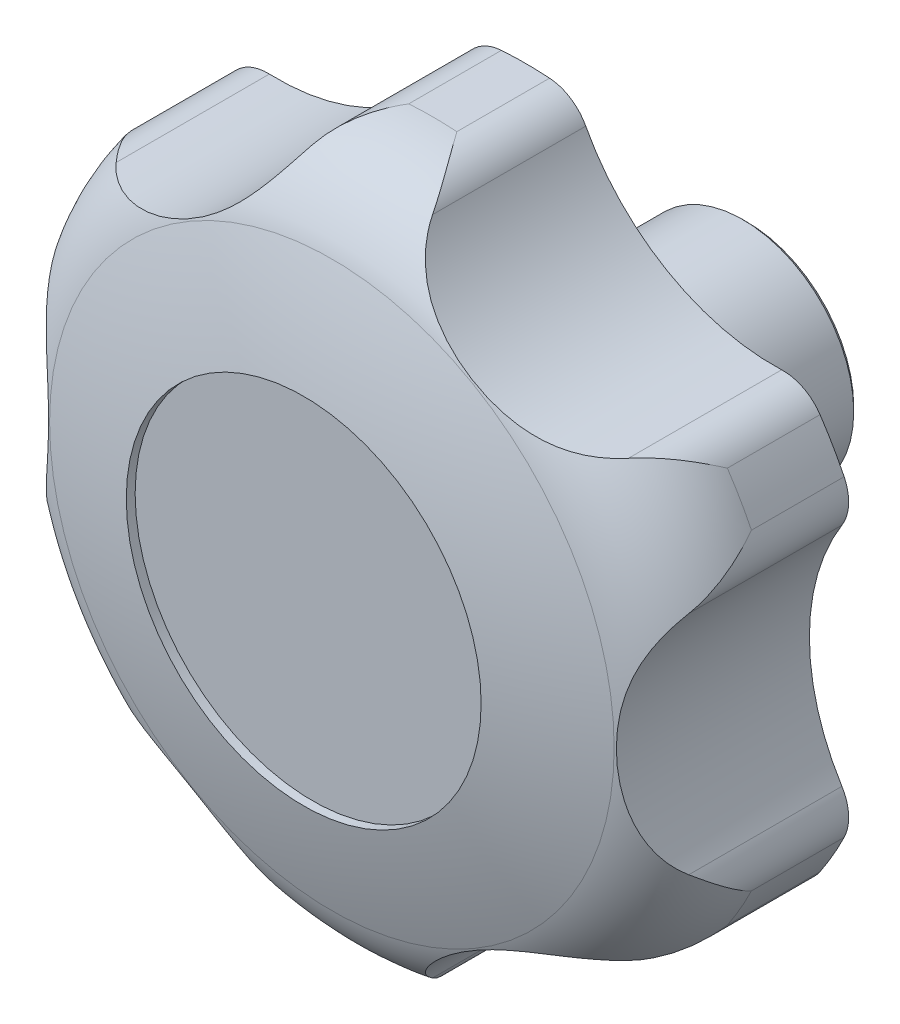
ISO-10303-21;
HEADER;
FILE_DESCRIPTION(('STEP AP214'),'2;1');
FILE_NAME('part.step','',(''),(''),'','','');
FILE_SCHEMA(('AUTOMOTIVE_DESIGN { 1 0 10303 214 1 1 1 1 }'));
ENDSEC;
DATA;
#1=APPLICATION_CONTEXT('core data for automotive mechanical design processes');
#2=APPLICATION_PROTOCOL_DEFINITION('international standard','automotive_design',2000,#1);
#3=PRODUCT_CONTEXT('',#1,'mechanical');
#4=PRODUCT('Part','Part','',(#3));
#5=PRODUCT_RELATED_PRODUCT_CATEGORY('part','',(#4));
#6=PRODUCT_DEFINITION_FORMATION('','',#4);
#7=PRODUCT_DEFINITION_CONTEXT('part definition',#1,'design');
#8=PRODUCT_DEFINITION('design','',#6,#7);
#9=PRODUCT_DEFINITION_SHAPE('','',#8);
#10=(LENGTH_UNIT() NAMED_UNIT(*) SI_UNIT(.MILLI.,.METRE.));
#11=(NAMED_UNIT(*) PLANE_ANGLE_UNIT() SI_UNIT($,.RADIAN.));
#12=(NAMED_UNIT(*) SI_UNIT($,.STERADIAN.) SOLID_ANGLE_UNIT());
#13=UNCERTAINTY_MEASURE_WITH_UNIT(LENGTH_MEASURE(1.E-05),#10,'distance_accuracy_value','');
#14=(GEOMETRIC_REPRESENTATION_CONTEXT(3) GLOBAL_UNCERTAINTY_ASSIGNED_CONTEXT((#13)) GLOBAL_UNIT_ASSIGNED_CONTEXT((#10,
#11,#12)) REPRESENTATION_CONTEXT('',''));
#15=CARTESIAN_POINT('',(0.,0.,0.));
#16=DIRECTION('',(0.,0.,1.));
#17=DIRECTION('',(1.,0.,0.));
#18=AXIS2_PLACEMENT_3D('',#15,#16,#17);
#19=CARTESIAN_POINT('',(0.,0.,64.59576815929));
#20=DIRECTION('',(0.,0.,1.));
#21=DIRECTION('',(1.,0.,0.));
#22=AXIS2_PLACEMENT_3D('',#19,#20,#21);
#23=CYLINDRICAL_SURFACE('',#22,40.);
#24=CARTESIAN_POINT('',(0.,0.,25.));
#25=DIRECTION('',(0.,0.,1.));
#26=DIRECTION('',(1.,0.,0.));
#27=AXIS2_PLACEMENT_3D('',#24,#25,#26);
#28=CIRCLE('',#27,40.);
#29=CARTESIAN_POINT('',(-33.2039586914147,22.3046436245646,25.));
#30=VERTEX_POINT('',#29);
#31=CARTESIAN_POINT('',(-35.9183673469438,17.603149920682,25.));
#32=VERTEX_POINT('',#31);
#33=EDGE_CURVE('E452',#30,#32,#28,.T.);
#34=ORIENTED_EDGE('',*,*,#33,.T.);
#35=DIRECTION('',(0.,0.,1.));
#36=VECTOR('',#35,1.);
#37=CARTESIAN_POINT('',(-35.9183673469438,17.603149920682,0.));
#38=LINE('',#37,#36);
#39=CARTESIAN_POINT('',(-35.9183673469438,17.603149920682,35.4470247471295));
#40=VERTEX_POINT('',#39);
#41=EDGE_CURVE('E182',#32,#40,#38,.T.);
#42=ORIENTED_EDGE('',*,*,#41,.T.);
#43=CARTESIAN_POINT('',(0.,0.,35.4470247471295));
#44=DIRECTION('',(0.,0.,1.));
#45=DIRECTION('',(1.,0.,0.));
#46=AXIS2_PLACEMENT_3D('',#43,#44,#45);
#47=CIRCLE('',#46,40.);
#48=CARTESIAN_POINT('',(-33.2039586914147,22.3046436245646,35.4470247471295));
#49=VERTEX_POINT('',#48);
#50=EDGE_CURVE('E197',#49,#40,#47,.T.);
#51=ORIENTED_EDGE('',*,*,#50,.F.);
#52=DIRECTION('',(0.,0.,1.));
#53=VECTOR('',#52,1.);
#54=CARTESIAN_POINT('',(-33.2039586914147,22.3046436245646,0.));
#55=LINE('',#54,#53);
#56=EDGE_CURVE('E521',#30,#49,#55,.T.);
#57=ORIENTED_EDGE('',*,*,#56,.F.);
#58=EDGE_LOOP('',(#34,#42,#51,#57));
#59=FACE_BOUND('',#58,.T.);
#60=ADVANCED_FACE('F14',(#59),#23,.T.);
#61=CARTESIAN_POINT('',(2.71440865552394,39.9077935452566,25.));
#62=VERTEX_POINT('',#61);
#63=CARTESIAN_POINT('',(-2.71440865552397,39.9077935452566,25.));
#64=VERTEX_POINT('',#63);
#65=EDGE_CURVE('E455',#62,#64,#28,.T.);
#66=ORIENTED_EDGE('',*,*,#65,.T.);
#67=DIRECTION('',(0.,0.,1.));
#68=VECTOR('',#67,1.);
#69=CARTESIAN_POINT('',(-2.71440865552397,39.9077935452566,0.));
#70=LINE('',#69,#68);
#71=CARTESIAN_POINT('',(-2.71440865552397,39.9077935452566,35.4470247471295));
#72=VERTEX_POINT('',#71);
#73=EDGE_CURVE('E527',#64,#72,#70,.T.);
#74=ORIENTED_EDGE('',*,*,#73,.T.);
#75=CARTESIAN_POINT('',(2.71440865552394,39.9077935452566,35.4470247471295));
#76=VERTEX_POINT('',#75);
#77=EDGE_CURVE('E469',#76,#72,#47,.T.);
#78=ORIENTED_EDGE('',*,*,#77,.F.);
#79=DIRECTION('',(0.,0.,1.));
#80=VECTOR('',#79,1.);
#81=CARTESIAN_POINT('',(2.71440865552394,39.9077935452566,0.));
#82=LINE('',#81,#80);
#83=EDGE_CURVE('E530',#62,#76,#82,.T.);
#84=ORIENTED_EDGE('',*,*,#83,.F.);
#85=EDGE_LOOP('',(#66,#74,#78,#84));
#86=FACE_BOUND('',#85,.T.);
#87=ADVANCED_FACE('F418',(#86),#23,.T.);
#88=CARTESIAN_POINT('',(35.9183673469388,17.603149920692,25.));
#89=VERTEX_POINT('',#88);
#90=CARTESIAN_POINT('',(33.2039586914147,22.3046436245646,25.));
#91=VERTEX_POINT('',#90);
#92=EDGE_CURVE('E458',#89,#91,#28,.T.);
#93=ORIENTED_EDGE('',*,*,#92,.T.);
#94=DIRECTION('',(0.,0.,1.));
#95=VECTOR('',#94,1.);
#96=CARTESIAN_POINT('',(33.2039586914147,22.3046436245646,0.));
#97=LINE('',#96,#95);
#98=CARTESIAN_POINT('',(33.2039586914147,22.3046436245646,35.4470247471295));
#99=VERTEX_POINT('',#98);
#100=EDGE_CURVE('E538',#91,#99,#97,.T.);
#101=ORIENTED_EDGE('',*,*,#100,.T.);
#102=CARTESIAN_POINT('',(35.9183673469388,17.603149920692,35.4470247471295));
#103=VERTEX_POINT('',#102);
#104=EDGE_CURVE('E465',#103,#99,#47,.T.);
#105=ORIENTED_EDGE('',*,*,#104,.F.);
#106=DIRECTION('',(0.,0.,1.));
#107=VECTOR('',#106,1.);
#108=CARTESIAN_POINT('',(35.9183673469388,17.603149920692,0.));
#109=LINE('',#108,#107);
#110=EDGE_CURVE('E541',#89,#103,#109,.T.);
#111=ORIENTED_EDGE('',*,*,#110,.F.);
#112=EDGE_LOOP('',(#93,#101,#105,#111));
#113=FACE_BOUND('',#112,.T.);
#114=ADVANCED_FACE('F426',(#113),#23,.T.);
#115=CARTESIAN_POINT('',(33.2039586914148,-22.3046436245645,25.));
#116=VERTEX_POINT('',#115);
#117=CARTESIAN_POINT('',(35.9183673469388,-17.603149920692,25.));
#118=VERTEX_POINT('',#117);
#119=EDGE_CURVE('E457',#116,#118,#28,.T.);
#120=ORIENTED_EDGE('',*,*,#119,.T.);
#121=DIRECTION('',(0.,0.,1.));
#122=VECTOR('',#121,1.);
#123=CARTESIAN_POINT('',(35.9183673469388,-17.603149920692,0.));
#124=LINE('',#123,#122);
#125=CARTESIAN_POINT('',(35.9183673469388,-17.603149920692,35.4470247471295));
#126=VERTEX_POINT('',#125);
#127=EDGE_CURVE('E37',#118,#126,#124,.T.);
#128=ORIENTED_EDGE('',*,*,#127,.T.);
#129=CARTESIAN_POINT('',(33.2039586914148,-22.3046436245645,35.4470247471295));
#130=VERTEX_POINT('',#129);
#131=EDGE_CURVE('E462',#130,#126,#47,.T.);
#132=ORIENTED_EDGE('',*,*,#131,.F.);
#133=DIRECTION('',(0.,0.,1.));
#134=VECTOR('',#133,1.);
#135=CARTESIAN_POINT('',(33.2039586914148,-22.3046436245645,0.));
#136=LINE('',#135,#134);
#137=EDGE_CURVE('E550',#116,#130,#136,.T.);
#138=ORIENTED_EDGE('',*,*,#137,.F.);
#139=EDGE_LOOP('',(#120,#128,#132,#138));
#140=FACE_BOUND('',#139,.T.);
#141=ADVANCED_FACE('F439',(#140),#23,.T.);
#142=CARTESIAN_POINT('',(-2.71440865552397,-39.9077935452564,25.));
#143=VERTEX_POINT('',#142);
#144=CARTESIAN_POINT('',(2.714408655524,-39.9077935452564,25.));
#145=VERTEX_POINT('',#144);
#146=EDGE_CURVE('E453',#143,#145,#28,.T.);
#147=ORIENTED_EDGE('',*,*,#146,.T.);
#148=DIRECTION('',(0.,0.,1.));
#149=VECTOR('',#148,1.);
#150=CARTESIAN_POINT('',(2.714408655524,-39.9077935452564,0.));
#151=LINE('',#150,#149);
#152=CARTESIAN_POINT('',(2.714408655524,-39.9077935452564,35.4470247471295));
#153=VERTEX_POINT('',#152);
#154=EDGE_CURVE('E558',#145,#153,#151,.T.);
#155=ORIENTED_EDGE('',*,*,#154,.T.);
#156=CARTESIAN_POINT('',(-2.71440865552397,-39.9077935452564,35.4470247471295));
#157=VERTEX_POINT('',#156);
#158=EDGE_CURVE('E574',#157,#153,#47,.T.);
#159=ORIENTED_EDGE('',*,*,#158,.F.);
#160=DIRECTION('',(0.,0.,1.));
#161=VECTOR('',#160,1.);
#162=CARTESIAN_POINT('',(-2.71440865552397,-39.9077935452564,0.));
#163=LINE('',#162,#161);
#164=EDGE_CURVE('E561',#143,#157,#163,.T.);
#165=ORIENTED_EDGE('',*,*,#164,.F.);
#166=EDGE_LOOP('',(#147,#155,#159,#165));
#167=FACE_BOUND('',#166,.T.);
#168=ADVANCED_FACE('F430',(#167),#23,.T.);
#169=CARTESIAN_POINT('',(-35.9183673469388,-17.603149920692,25.));
#170=VERTEX_POINT('',#169);
#171=CARTESIAN_POINT('',(-33.2039586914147,-22.3046436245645,25.));
#172=VERTEX_POINT('',#171);
#173=EDGE_CURVE('E445',#170,#172,#28,.T.);
#174=ORIENTED_EDGE('',*,*,#173,.T.);
#175=DIRECTION('',(0.,0.,1.));
#176=VECTOR('',#175,1.);
#177=CARTESIAN_POINT('',(-33.2039586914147,-22.3046436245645,0.));
#178=LINE('',#177,#176);
#179=CARTESIAN_POINT('',(-33.2039586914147,-22.3046436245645,35.4470247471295));
#180=VERTEX_POINT('',#179);
#181=EDGE_CURVE('E447',#172,#180,#178,.T.);
#182=ORIENTED_EDGE('',*,*,#181,.T.);
#183=CARTESIAN_POINT('',(-35.9183673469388,-17.603149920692,35.4470247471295));
#184=VERTEX_POINT('',#183);
#185=EDGE_CURVE('E573',#184,#180,#47,.T.);
#186=ORIENTED_EDGE('',*,*,#185,.F.);
#187=DIRECTION('',(0.,0.,1.));
#188=VECTOR('',#187,1.);
#189=CARTESIAN_POINT('',(-35.9183673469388,-17.603149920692,0.));
#190=LINE('',#189,#188);
#191=EDGE_CURVE('E449',#170,#184,#190,.T.);
#192=ORIENTED_EDGE('',*,*,#191,.F.);
#193=EDGE_LOOP('',(#174,#182,#186,#192));
#194=FACE_BOUND('',#193,.T.);
#195=ADVANCED_FACE('F420',(#194),#23,.T.);
#196=CARTESIAN_POINT('',(0.,0.,0.));
#197=DIRECTION('',(0.,0.,1.));
#198=DIRECTION('',(1.,0.,0.));
#199=AXIS2_PLACEMENT_3D('',#196,#197,#198);
#200=CONICAL_SURFACE('',#199,12.,0.785398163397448);
#201=CARTESIAN_POINT('',(0.,0.,0.5));
#202=DIRECTION('',(0.,0.,1.));
#203=DIRECTION('',(1.,0.,0.));
#204=AXIS2_PLACEMENT_3D('',#201,#202,#203);
#205=CIRCLE('',#204,12.5);
#206=CARTESIAN_POINT('',(12.5,0.,0.5));
#207=VERTEX_POINT('',#206);
#208=EDGE_CURVE('E594',#207,#207,#205,.T.);
#209=ORIENTED_EDGE('',*,*,#208,.F.);
#210=EDGE_LOOP('',(#209));
#211=FACE_BOUND('',#210,.T.);
#212=CARTESIAN_POINT('',(0.,0.,0.));
#213=DIRECTION('',(0.,0.,1.));
#214=DIRECTION('',(1.,0.,0.));
#215=AXIS2_PLACEMENT_3D('',#212,#213,#214);
#216=CIRCLE('',#215,12.);
#217=CARTESIAN_POINT('',(12.,0.,0.));
#218=VERTEX_POINT('',#217);
#219=EDGE_CURVE('E472',#218,#218,#216,.T.);
#220=ORIENTED_EDGE('',*,*,#219,.T.);
#221=EDGE_LOOP('',(#220));
#222=FACE_BOUND('',#221,.T.);
#223=ADVANCED_FACE('F16',(#211,#222),#200,.T.);
#224=CARTESIAN_POINT('',(0.,1.94289029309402E-13,0.));
#225=DIRECTION('',(0.,0.,1.));
#226=DIRECTION('',(1.,0.,0.));
#227=AXIS2_PLACEMENT_3D('',#224,#225,#226);
#228=PLANE('',#227);
#229=ORIENTED_EDGE('',*,*,#219,.F.);
#230=EDGE_LOOP('',(#229));
#231=FACE_BOUND('',#230,.T.);
#232=ADVANCED_FACE('F437',(#231),#228,.F.);
#233=CARTESIAN_POINT('',(0.,0.,-47.979589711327));
#234=DIRECTION('',(1.,0.,0.));
#235=DIRECTION('',(0.,0.,-1.));
#236=AXIS2_PLACEMENT_3D('',#233,#234,#235);
#237=SPHERICAL_SURFACE('',#236,100.);
#238=CARTESIAN_POINT('',(0.,0.,-47.979589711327));
#239=DIRECTION('',(0.,0.,1.));
#240=DIRECTION('',(1.,0.,0.));
#241=AXIS2_PLACEMENT_3D('',#238,#239,#240);
#242=SPHERICAL_SURFACE('',#241,100.);
#243=CARTESIAN_POINT('',(0.,0.,46.823381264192));
#244=DIRECTION('',(0.,0.,1.));
#245=DIRECTION('',(1.,0.,0.));
#246=AXIS2_PLACEMENT_3D('',#243,#244,#245);
#247=CIRCLE('',#246,31.8181818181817);
#248=CARTESIAN_POINT('',(31.8181818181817,0.,46.823381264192));
#249=VERTEX_POINT('',#248);
#250=EDGE_CURVE('E468',#249,#249,#247,.T.);
#251=ORIENTED_EDGE('',*,*,#250,.T.);
#252=EDGE_LOOP('',(#251));
#253=FACE_BOUND('',#252,.T.);
#254=CARTESIAN_POINT('',(0.,0.,50.));
#255=DIRECTION('',(0.,0.,1.));
#256=DIRECTION('',(1.,0.,0.));
#257=AXIS2_PLACEMENT_3D('',#254,#255,#256);
#258=CIRCLE('',#257,20.);
#259=CARTESIAN_POINT('',(20.,0.,50.));
#260=VERTEX_POINT('',#259);
#261=EDGE_CURVE('E198',#260,#260,#258,.T.);
#262=ORIENTED_EDGE('',*,*,#261,.F.);
#263=EDGE_LOOP('',(#262));
#264=FACE_BOUND('',#263,.T.);
#265=ADVANCED_FACE('F603',(#253,#264),#242,.T.);
#266=CARTESIAN_POINT('',(0.,0.,35.44702474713));
#267=DIRECTION('',(0.,0.,1.));
#268=DIRECTION('',(1.,0.,0.));
#269=AXIS2_PLACEMENT_3D('',#266,#267,#268);
#270=TOROIDAL_SURFACE('',#269,28.,12.);
#271=CARTESIAN_POINT('',(-33.2039586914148,22.3046436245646,35.44702474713));
#272=CARTESIAN_POINT('',(-33.2016458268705,22.3080866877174,35.4530354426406));
#273=CARTESIAN_POINT('',(-33.1993286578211,22.3115269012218,35.4590461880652));
#274=CARTESIAN_POINT('',(-33.0621842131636,22.5145941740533,35.8141433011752));
#275=CARTESIAN_POINT('',(-32.9128604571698,22.7045847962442,36.1633854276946));
#276=CARTESIAN_POINT('',(-32.5872275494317,23.062127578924,36.860845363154));
#277=CARTESIAN_POINT('',(-32.4109089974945,23.2296718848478,37.2090627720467));
#278=CARTESIAN_POINT('',(-32.0328927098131,23.5393466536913,37.9038529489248));
#279=CARTESIAN_POINT('',(-31.8311572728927,23.6814385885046,38.2504224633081));
#280=CARTESIAN_POINT('',(-31.4045582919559,23.9362981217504,38.9399718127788));
#281=CARTESIAN_POINT('',(-31.1797053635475,24.0490790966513,39.2829532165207));
#282=CARTESIAN_POINT('',(-30.7879651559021,24.2091174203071,39.8497011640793));
#283=CARTESIAN_POINT('',(-30.6268988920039,24.2656677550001,40.0749071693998));
#284=CARTESIAN_POINT('',(-30.2963113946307,24.3626945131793,40.5224669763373));
#285=CARTESIAN_POINT('',(-30.1267933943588,24.4031770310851,40.744821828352));
#286=CARTESIAN_POINT('',(-29.7801340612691,24.466615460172,41.1860795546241));
#287=CARTESIAN_POINT('',(-29.6029933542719,24.4895728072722,41.4049827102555));
#288=CARTESIAN_POINT('',(-29.2420201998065,24.5162777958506,41.8387209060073));
#289=CARTESIAN_POINT('',(-29.0581817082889,24.5200076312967,42.0535519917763));
#290=CARTESIAN_POINT('',(-28.8716321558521,24.5132558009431,42.2658258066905));
#291=B_SPLINE_CURVE_WITH_KNOTS('',3,(#271,#272,#273,#274,#275,#276,#277,#278,#279,#280,#281,
#282,#283,#284,#285,#286,#287,#288,#289,#290),.UNSPECIFIED.,.F.,.F.,(4,2,2,2,2,2,2,2,2,4),(0.,
0.0219089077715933,1.29430371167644,2.5671426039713,3.84189224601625,5.11605911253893,
5.96330602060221,6.8102312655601,7.65708711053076,8.50472706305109),.UNSPECIFIED.);
#292=CARTESIAN_POINT('',(-28.8718321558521,24.5132630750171,42.2655982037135));
#293=VERTEX_POINT('',#292);
#294=EDGE_CURVE('E199',#49,#293,#291,.T.);
#295=ORIENTED_EDGE('',*,*,#294,.F.);
#296=ORIENTED_EDGE('',*,*,#50,.T.);
#297=CARTESIAN_POINT('',(-35.6648992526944,12.7469085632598,42.2658666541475));
#298=CARTESIAN_POINT('',(-35.7234532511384,12.8403174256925,42.1404930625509));
#299=CARTESIAN_POINT('',(-35.7783600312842,12.9347527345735,42.0142254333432));
#300=CARTESIAN_POINT('',(-35.8810719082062,13.1252663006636,41.7600922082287));
#301=CARTESIAN_POINT('',(-35.9288784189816,13.2213442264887,41.6322269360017));
#302=CARTESIAN_POINT('',(-36.0618532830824,13.5112308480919,41.2467805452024));
#303=CARTESIAN_POINT('',(-36.1367290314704,13.7069387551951,40.9870200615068));
#304=CARTESIAN_POINT('',(-36.2603267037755,14.1002303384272,40.4635033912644));
#305=CARTESIAN_POINT('',(-36.3090884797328,14.2978106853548,40.1997539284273));
#306=CARTESIAN_POINT('',(-36.3820057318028,14.6929287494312,39.6687368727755));
#307=CARTESIAN_POINT('',(-36.4061527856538,14.8904664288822,39.4014681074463));
#308=CARTESIAN_POINT('',(-36.4325564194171,15.3076554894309,38.8311912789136));
#309=CARTESIAN_POINT('',(-36.4317470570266,15.5270305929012,38.5278395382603));
#310=CARTESIAN_POINT('',(-36.4021049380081,15.9605923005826,37.9187847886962));
#311=CARTESIAN_POINT('',(-36.3732684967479,16.1747782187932,37.6130814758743));
#312=CARTESIAN_POINT('',(-36.2889979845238,16.5953080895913,37.0006549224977));
#313=CARTESIAN_POINT('',(-36.2336026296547,16.8016629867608,36.6939338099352));
#314=CARTESIAN_POINT('',(-36.0974410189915,17.2046623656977,36.079792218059));
#315=CARTESIAN_POINT('',(-36.0166818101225,17.4013095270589,35.7723719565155));
#316=CARTESIAN_POINT('',(-35.9220134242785,17.5956985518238,35.4590461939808));
#317=CARTESIAN_POINT('',(-35.9201926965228,17.5994253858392,35.453035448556));
#318=CARTESIAN_POINT('',(-35.9183673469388,17.603149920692,35.44702474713));
#319=B_SPLINE_CURVE_WITH_KNOTS('',3,(#297,#298,#299,#300,#301,#302,#303,#304,#305,#306,#307,
#308,#309,#310,#311,#312,#313,#314,#315,#316,#317,#318),.UNSPECIFIED.,.F.,.F.,(4,2,2,2,2,2,2,2,
2,2,4),(0.,0.50074643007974,1.0013930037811,2.0013764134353,2.99982938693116,3.99862388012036,
5.12056047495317,6.24264458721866,7.36309793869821,8.48324026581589,8.50514917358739),.UNSPECIFIED.);
#320=CARTESIAN_POINT('',(-35.6650246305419,12.7471085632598,42.2655982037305));
#321=VERTEX_POINT('',#320);
#322=EDGE_CURVE('E186',#321,#40,#319,.T.);
#323=ORIENTED_EDGE('',*,*,#322,.F.);
#324=CARTESIAN_POINT('',(-35.6651500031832,12.7473085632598,42.2653297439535));
#325=CARTESIAN_POINT('',(-35.6085788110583,12.657064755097,42.3864729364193));
#326=CARTESIAN_POINT('',(-35.5511259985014,12.5640789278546,42.505127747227));
#327=CARTESIAN_POINT('',(-35.4348010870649,12.372757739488,42.7373042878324));
#328=CARTESIAN_POINT('',(-35.3759290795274,12.2744227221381,42.8508263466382));
#329=CARTESIAN_POINT('',(-35.1978187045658,11.9717980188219,43.183239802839));
#330=CARTESIAN_POINT('',(-35.0769610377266,11.759691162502,43.3942434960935));
#331=CARTESIAN_POINT('',(-34.8351019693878,11.3185575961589,43.7921481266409));
#332=CARTESIAN_POINT('',(-34.7141137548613,11.0897185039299,43.9792663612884));
#333=CARTESIAN_POINT('',(-34.4734853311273,10.6150811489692,44.3316300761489));
#334=CARTESIAN_POINT('',(-34.3538453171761,10.3692804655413,44.4968724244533));
#335=CARTESIAN_POINT('',(-34.118747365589,9.86348535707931,44.8053655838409));
#336=CARTESIAN_POINT('',(-34.003278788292,9.60353201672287,44.9486758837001));
#337=CARTESIAN_POINT('',(-33.7783302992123,9.0708864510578,45.2147402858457));
#338=CARTESIAN_POINT('',(-33.6688502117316,8.79819459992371,45.3374949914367));
#339=CARTESIAN_POINT('',(-33.4574270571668,8.2414359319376,45.5640287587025));
#340=CARTESIAN_POINT('',(-33.355501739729,7.95734460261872,45.6677639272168));
#341=CARTESIAN_POINT('',(-33.1608918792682,7.3802416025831,45.8575354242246));
#342=CARTESIAN_POINT('',(-33.0682085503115,7.08722876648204,45.9435694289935));
#343=CARTESIAN_POINT('',(-32.8468004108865,6.33664057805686,46.1411058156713));
#344=CARTESIAN_POINT('',(-32.7250175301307,5.87417592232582,46.2419297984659));
#345=CARTESIAN_POINT('',(-32.5084193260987,4.93732591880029,46.4126100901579));
#346=CARTESIAN_POINT('',(-32.4136174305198,4.46293476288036,46.4824509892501));
#347=CARTESIAN_POINT('',(-32.2523910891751,3.50533052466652,46.5968256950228));
#348=CARTESIAN_POINT('',(-32.1860288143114,3.02210049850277,46.6413041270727));
#349=CARTESIAN_POINT('',(-32.0828256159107,2.05113738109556,46.7089202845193));
#350=CARTESIAN_POINT('',(-32.0459807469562,1.56340490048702,46.7320608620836));
#351=CARTESIAN_POINT('',(-32.0014874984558,0.570823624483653,46.7598837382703));
#352=CARTESIAN_POINT('',(-31.9947863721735,0.0659157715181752,46.7639673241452));
#353=CARTESIAN_POINT('',(-32.0132306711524,-0.943168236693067,46.7525345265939));
#354=CARTESIAN_POINT('',(-32.0383802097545,-1.44734428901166,46.7370156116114));
#355=CARTESIAN_POINT('',(-32.1202170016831,-2.45139648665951,46.6846206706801));
#356=CARTESIAN_POINT('',(-32.1768642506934,-2.95127727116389,46.647771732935));
#357=CARTESIAN_POINT('',(-32.3209795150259,-3.94402208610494,46.5488585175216));
#358=CARTESIAN_POINT('',(-32.4084384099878,-4.43688814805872,46.4868017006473));
#359=CARTESIAN_POINT('',(-32.5883264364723,-5.29501706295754,46.3503630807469));
#360=CARTESIAN_POINT('',(-32.6745687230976,-5.66261664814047,46.2824745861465));
#361=CARTESIAN_POINT('',(-32.8630501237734,-6.38923539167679,46.1258564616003));
#362=CARTESIAN_POINT('',(-32.9652885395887,-6.74825492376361,46.0371277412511));
#363=CARTESIAN_POINT('',(-33.1840934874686,-7.45459097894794,45.8358574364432));
#364=CARTESIAN_POINT('',(-33.3006411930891,-7.80192212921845,45.7233470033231));
#365=CARTESIAN_POINT('',(-33.5459960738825,-8.48223685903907,45.4714791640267));
#366=CARTESIAN_POINT('',(-33.6748001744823,-8.81522400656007,45.3321284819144));
#367=CARTESIAN_POINT('',(-33.9165908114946,-9.40234329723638,45.0531451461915));
#368=CARTESIAN_POINT('',(-34.0279848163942,-9.65951147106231,44.9185129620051));
#369=CARTESIAN_POINT('',(-34.2549904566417,-10.1602198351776,44.6290220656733));
#370=CARTESIAN_POINT('',(-34.3706011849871,-10.4037629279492,44.474167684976));
#371=CARTESIAN_POINT('',(-34.6036653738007,-10.8750119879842,44.1439922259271));
#372=CARTESIAN_POINT('',(-34.7211158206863,-11.1027410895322,43.9687020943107));
#373=CARTESIAN_POINT('',(-34.9555495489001,-11.5409190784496,43.5975963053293));
#374=CARTESIAN_POINT('',(-35.0725330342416,-11.7513765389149,43.4017909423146));
#375=CARTESIAN_POINT('',(-35.2696517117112,-12.0946088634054,43.0505692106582));
#376=CARTESIAN_POINT('',(-35.3505397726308,-12.2320760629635,42.9001303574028));
#377=CARTESIAN_POINT('',(-35.509879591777,-12.4971557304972,42.5897662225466));
#378=CARTESIAN_POINT('',(-35.5883327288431,-12.6247738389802,42.4298464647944));
#379=CARTESIAN_POINT('',(-35.6651500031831,-12.7473085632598,42.2653297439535));
#380=B_SPLINE_CURVE_WITH_KNOTS('',3,(#324,#325,#326,#327,#328,#329,#330,#331,#332,#333,#334,
#335,#336,#337,#338,#339,#340,#341,#342,#343,#344,#345,#346,#347,#348,#349,#350,#351,#352,#353,
#354,#355,#356,#357,#358,#359,#360,#361,#362,#363,#364,#365,#366,#367,#368,#369,#370,#371,#372,
#373,#374,#375,#376,#377,#378,#379),.UNSPECIFIED.,.F.,.F.,(4,2,2,2,2,2,2,2,2,2,2,2,2,2,2,2,2,2,
2,2,2,2,2,2,2,2,2,4),(0.,0.483826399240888,0.967621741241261,1.93415653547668,2.89115364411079,
3.84828761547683,4.80277758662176,5.75723953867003,6.71387720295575,7.67064037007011,
9.13462899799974,10.5993449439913,12.0672467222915,13.5349522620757,15.0484714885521,
16.5621861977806,18.0739827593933,19.5853321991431,20.7353651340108,21.8853478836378,
23.03383351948,24.1820318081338,25.1138844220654,26.0455377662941,26.9757981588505,
27.905593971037,28.5629371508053,29.2199010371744),.UNSPECIFIED.);
#381=CARTESIAN_POINT('',(-35.6650246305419,-12.7471085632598,42.2655982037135));
#382=VERTEX_POINT('',#381);
#383=EDGE_CURVE('E174',#321,#382,#380,.T.);
#384=ORIENTED_EDGE('',*,*,#383,.T.);
#385=CARTESIAN_POINT('',(-35.9183673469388,-17.603149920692,35.44702474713));
#386=CARTESIAN_POINT('',(-35.9201926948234,-17.5994253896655,35.4530354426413));
#387=CARTESIAN_POINT('',(-35.9220134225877,-17.5956985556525,35.4590461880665));
#388=CARTESIAN_POINT('',(-36.0293026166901,-17.375394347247,35.8141432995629));
#389=CARTESIAN_POINT('',(-36.1191774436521,-17.1510808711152,36.1633854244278));
#390=CARTESIAN_POINT('',(-36.2660021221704,-16.6903031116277,36.8608453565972));
#391=CARTESIAN_POINT('',(-36.322940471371,-16.4538346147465,37.2090627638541));
#392=CARTESIAN_POINT('',(-36.4021185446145,-15.9716255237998,37.9038529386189));
#393=CARTESIAN_POINT('',(-36.4243060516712,-15.7258715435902,38.2504224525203));
#394=CARTESIAN_POINT('',(-36.4317213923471,-15.2289962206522,38.9399718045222));
#395=CARTESIAN_POINT('',(-36.4169661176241,-14.977877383,39.2829532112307));
#396=CARTESIAN_POINT('',(-36.3596929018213,-14.5585985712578,39.8497047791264));
#397=CARTESIAN_POINT('',(-36.3281331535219,-14.390833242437,40.0749143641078));
#398=CARTESIAN_POINT('',(-36.2468651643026,-14.0560173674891,40.5224812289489));
#399=CARTESIAN_POINT('',(-36.1971638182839,-13.8889665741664,40.7448395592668));
#400=CARTESIAN_POINT('',(-36.0787703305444,-13.5570263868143,41.1861041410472));
#401=CARTESIAN_POINT('',(-36.0100797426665,-13.3921368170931,41.4050106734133));
#402=CARTESIAN_POINT('',(-35.8527159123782,-13.0661675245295,41.8387554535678));
#403=CARTESIAN_POINT('',(-35.764024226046,-12.9050914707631,42.0535897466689));
#404=CARTESIAN_POINT('',(-35.6648992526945,-12.7469085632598,42.2658666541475));
#405=B_SPLINE_CURVE_WITH_KNOTS('',3,(#385,#386,#387,#388,#389,#390,#391,#392,#393,#394,#395,
#396,#397,#398,#399,#400,#401,#402,#403,#404),.UNSPECIFIED.,.F.,.F.,(4,2,2,2,2,2,2,2,2,4),(0.,
0.0219089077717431,1.29430370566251,2.56714259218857,3.84189223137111,5.11605911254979,
5.96331954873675,6.81025830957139,7.6571277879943,8.50478141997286),.UNSPECIFIED.);
#406=EDGE_CURVE('E181',#184,#382,#405,.T.);
#407=ORIENTED_EDGE('',*,*,#406,.F.);
#408=ORIENTED_EDGE('',*,*,#185,.T.);
#409=CARTESIAN_POINT('',(-28.8716321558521,-24.5132558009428,42.2658258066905));
#410=CARTESIAN_POINT('',(-28.9818038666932,-24.5172598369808,42.1404514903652));
#411=CARTESIAN_POINT('',(-29.0910408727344,-24.5175920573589,42.0141831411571));
#412=CARTESIAN_POINT('',(-29.3073868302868,-24.5112847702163,41.7600484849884));
#413=CARTESIAN_POINT('',(-29.4144962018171,-24.5046466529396,41.6321825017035));
#414=CARTESIAN_POINT('',(-29.7320333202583,-24.4748605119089,41.2467339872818));
#415=CARTESIAN_POINT('',(-29.9389594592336,-24.4418492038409,40.9869721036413));
#416=CARTESIAN_POINT('',(-30.34135909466,-24.3522387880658,40.4634526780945));
#417=CARTESIAN_POINT('',(-30.5368496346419,-24.2956758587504,40.1997018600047));
#418=CARTESIAN_POINT('',(-30.9154904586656,-24.1612616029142,39.6686821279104));
#419=CARTESIAN_POINT('',(-31.098636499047,-24.083403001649,39.4014120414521));
#420=CARTESIAN_POINT('',(-31.4731301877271,-23.8976729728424,38.8311384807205));
#421=CARTESIAN_POINT('',(-31.6627059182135,-23.7872849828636,38.5277913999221));
#422=CARTESIAN_POINT('',(-32.0233528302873,-23.5448350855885,37.9187460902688));
#423=CARTESIAN_POINT('',(-32.1944215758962,-23.4127703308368,37.6130475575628));
#424=CARTESIAN_POINT('',(-32.5164695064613,-23.1295282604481,37.0006306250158));
#425=CARTESIAN_POINT('',(-32.6674775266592,-22.9783790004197,36.6939143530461));
#426=CARTESIAN_POINT('',(-32.948399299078,-22.6589644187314,36.079782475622));
#427=CARTESIAN_POINT('',(-33.0783188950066,-22.4907038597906,35.7723670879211));
#428=CARTESIAN_POINT('',(-33.1993286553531,-22.3115269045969,35.4590461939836));
#429=CARTESIAN_POINT('',(-33.2016458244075,-22.3080866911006,35.4530354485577));
#430=CARTESIAN_POINT('',(-33.2039586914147,-22.3046436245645,35.44702474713));
#431=B_SPLINE_CURVE_WITH_KNOTS('',3,(#409,#410,#411,#412,#413,#414,#415,#416,#417,#418,#419,
#420,#421,#422,#423,#424,#425,#426,#427,#428,#429,#430),.UNSPECIFIED.,.F.,.F.,(4,2,2,2,2,2,2,2,
2,2,4),(0.,0.500748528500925,1.00139720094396,2.00138482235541,2.99984196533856,3.9986406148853,
5.12055943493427,6.24262574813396,7.36306133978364,8.48318592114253,8.50509482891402),.UNSPECIFIED.);
#432=CARTESIAN_POINT('',(-28.8718321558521,-24.5132630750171,42.2655982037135));
#433=VERTEX_POINT('',#432);
#434=EDGE_CURVE('E246',#433,#180,#431,.T.);
#435=ORIENTED_EDGE('',*,*,#434,.F.);
#436=CARTESIAN_POINT('',(-28.8720321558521,-24.5132703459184,42.265370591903));
#437=CARTESIAN_POINT('',(-28.7655922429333,-24.509400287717,42.3865135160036));
#438=CARTESIAN_POINT('',(-28.6563368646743,-24.506137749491,42.505168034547));
#439=CARTESIAN_POINT('',(-28.432483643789,-24.5010583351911,42.7373439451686));
#440=CARTESIAN_POINT('',(-28.3178861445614,-24.4992413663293,42.8508656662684));
#441=CARTESIAN_POINT('',(-27.9667476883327,-24.4963061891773,43.1832780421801));
#442=CARTESIAN_POINT('',(-27.7226272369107,-24.4976942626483,43.3942809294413));
#443=CARTESIAN_POINT('',(-27.2196615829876,-24.5088059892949,43.7921837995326));
#444=CARTESIAN_POINT('',(-26.9609854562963,-24.5184472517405,43.9793010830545));
#445=CARTESIAN_POINT('',(-26.4296202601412,-24.5473768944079,44.3316628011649));
#446=CARTESIAN_POINT('',(-26.1569291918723,-24.5666666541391,44.4969041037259));
#447=CARTESIAN_POINT('',(-25.6013461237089,-24.6159649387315,44.8053951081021));
#448=CARTESIAN_POINT('',(-25.3184843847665,-24.6459437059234,44.9487043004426));
#449=CARTESIAN_POINT('',(-24.7447231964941,-24.7174571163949,45.2147664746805));
#450=CARTESIAN_POINT('',(-24.4538239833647,-24.7589914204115,45.3375200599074));
#451=CARTESIAN_POINT('',(-23.8659431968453,-24.8542748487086,45.5640516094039));
#452=CARTESIAN_POINT('',(-23.5689492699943,-24.9080516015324,45.6677856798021));
#453=CARTESIAN_POINT('',(-22.9718567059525,-25.0280680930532,45.8575550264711));
#454=CARTESIAN_POINT('',(-22.6717576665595,-25.0943094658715,45.9435879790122));
#455=CARTESIAN_POINT('',(-21.9110220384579,-25.2778615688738,46.1411221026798));
#456=CARTESIAN_POINT('',(-21.4496222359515,-25.4036289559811,46.2419448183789));
#457=CARTESIAN_POINT('',(-20.5299830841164,-25.6844789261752,46.4126226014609));
#458=CARTESIAN_POINT('',(-20.0717454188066,-25.8395760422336,46.482462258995));
#459=CARTESIAN_POINT('',(-19.1618190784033,-26.1787570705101,46.5968345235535));
#460=CARTESIAN_POINT('',(-18.710146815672,-26.3629032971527,46.6413117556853));
#461=CARTESIAN_POINT('',(-17.8176634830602,-26.7590137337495,46.7089255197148));
#462=CARTESIAN_POINT('',(-17.3768509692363,-26.9709742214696,46.7320649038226));
#463=CARTESIAN_POINT('',(-16.4950014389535,-27.4287384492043,46.7598852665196));
#464=CARTESIAN_POINT('',(-16.0543869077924,-27.6753920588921,46.7639675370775));
#465=CARTESIAN_POINT('',(-15.1897151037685,-28.1959134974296,46.7525318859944));
#466=CARTESIAN_POINT('',(-14.7656599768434,-28.4697848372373,46.7370114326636));
#467=CARTESIAN_POINT('',(-13.9370427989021,-29.0426900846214,46.684613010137));
#468=CARTESIAN_POINT('',(-13.5324567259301,-29.3416916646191,46.6477621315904));
#469=CARTESIAN_POINT('',(-12.7447720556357,-29.9628780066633,46.5488444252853));
#470=CARTESIAN_POINT('',(-12.3616671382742,-30.2850558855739,46.4867850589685));
#471=CARTESIAN_POINT('',(-11.7084538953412,-30.8699103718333,46.3503419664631));
#472=CARTESIAN_POINT('',(-11.4332282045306,-31.128397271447,46.2824519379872));
#473=CARTESIAN_POINT('',(-10.8982060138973,-31.6549341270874,46.1258307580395));
#474=CARTESIAN_POINT('',(-10.6384088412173,-31.9229836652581,46.0371005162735));
#475=CARTESIAN_POINT('',(-10.1361135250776,-32.4656393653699,45.8358272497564));
#476=CARTESIAN_POINT('',(-9.89359330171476,-32.7402365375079,45.723315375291));
#477=CARTESIAN_POINT('',(-9.42710779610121,-33.2928737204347,45.4714448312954));
#478=CARTESIAN_POINT('',(-9.2031378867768,-33.5709128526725,45.3320928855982));
#479=CARTESIAN_POINT('',(-8.81557789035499,-34.0738665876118,45.0531067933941));
#480=CARTESIAN_POINT('',(-8.64856236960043,-34.2989200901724,44.9184729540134));
#481=CARTESIAN_POINT('',(-8.32844232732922,-34.7458654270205,44.6289787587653));
#482=CARTESIAN_POINT('',(-8.17533483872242,-34.9677579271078,44.4741227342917));
#483=CARTESIAN_POINT('',(-7.88375656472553,-35.4052199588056,44.1439440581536));
#484=CARTESIAN_POINT('',(-7.7452642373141,-35.6207984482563,43.9686523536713));
#485=CARTESIAN_POINT('',(-7.48301106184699,-36.0429105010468,43.5975435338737));
#486=CARTESIAN_POINT('',(-7.35924289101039,-36.2494485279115,43.4017367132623));
#487=CARTESIAN_POINT('',(-7.1605629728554,-36.5917616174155,43.0505232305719));
#488=CARTESIAN_POINT('',(-7.08196345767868,-36.7305353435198,42.9000947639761));
#489=CARTESIAN_POINT('',(-6.93207963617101,-37.0010465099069,42.5897528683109));
#490=CARTESIAN_POINT('',(-6.86079113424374,-37.1327879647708,42.4298449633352));
#491=CARTESIAN_POINT('',(-6.79308650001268,-37.2605716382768,42.2653407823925));
#492=B_SPLINE_CURVE_WITH_KNOTS('',3,(#436,#437,#438,#439,#440,#441,#442,#443,#444,#445,#446,
#447,#448,#449,#450,#451,#452,#453,#454,#455,#456,#457,#458,#459,#460,#461,#462,#463,#464,#465,
#466,#467,#468,#469,#470,#471,#472,#473,#474,#475,#476,#477,#478,#479,#480,#481,#482,#483,#484,
#485,#486,#487,#488,#489,#490,#491),.UNSPECIFIED.,.F.,.F.,(4,2,2,2,2,2,2,2,2,2,2,2,2,2,2,2,2,2,
2,2,2,2,2,2,2,2,2,4),(0.,0.483827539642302,0.967624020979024,1.9341610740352,2.89116033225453,
3.84829645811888,4.80278850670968,5.75725253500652,6.7138923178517,7.67065760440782,
9.13465337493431,10.5993764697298,12.0672854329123,13.5349981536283,15.048524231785,
16.5622458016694,18.0740490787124,19.5854052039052,20.735429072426,21.8854027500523,
23.0338793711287,24.1820686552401,25.1139194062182,26.0455708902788,26.9758294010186,
27.9056233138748,28.5629173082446,29.2198319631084),.UNSPECIFIED.);
#493=CARTESIAN_POINT('',(-6.79319247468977,-37.2603716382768,42.2655982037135));
#494=VERTEX_POINT('',#493);
#495=EDGE_CURVE('E252',#433,#494,#492,.T.);
#496=ORIENTED_EDGE('',*,*,#495,.T.);
#497=CARTESIAN_POINT('',(-2.71440865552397,-39.9077935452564,35.44702474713));
#498=CARTESIAN_POINT('',(-2.71854686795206,-39.907512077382,35.4530354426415));
#499=CARTESIAN_POINT('',(-2.72268476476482,-39.9072254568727,35.4590461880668));
#500=CARTESIAN_POINT('',(-2.96711840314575,-39.8899885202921,35.814143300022));
#501=CARTESIAN_POINT('',(-3.20631698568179,-39.8556656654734,36.163385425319));
#502=CARTESIAN_POINT('',(-3.67877457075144,-39.7524306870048,36.8608453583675));
#503=CARTESIAN_POINT('',(-3.91203147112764,-39.6835064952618,37.2090627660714));
#504=CARTESIAN_POINT('',(-4.36922583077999,-39.5109721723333,37.9038529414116));
#505=CARTESIAN_POINT('',(-4.59314877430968,-39.4073101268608,38.2504224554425));
#506=CARTESIAN_POINT('',(-5.02716309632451,-39.1652943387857,38.9399718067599));
#507=CARTESIAN_POINT('',(-5.23726075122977,-39.0269564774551,39.282953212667));
#508=CARTESIAN_POINT('',(-5.57172966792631,-38.7677174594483,39.8497038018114));
#509=CARTESIAN_POINT('',(-5.70123828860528,-38.6565037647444,40.0749124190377));
#510=CARTESIAN_POINT('',(-5.95056235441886,-38.4187168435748,40.5224773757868));
#511=CARTESIAN_POINT('',(-6.07038146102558,-38.2921494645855,40.7448347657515));
#512=CARTESIAN_POINT('',(-6.29865255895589,-38.0236490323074,41.1860974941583));
#513=CARTESIAN_POINT('',(-6.40710547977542,-37.8817172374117,41.4050031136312));
#514=CARTESIAN_POINT('',(-6.61072071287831,-37.5824532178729,41.8387461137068));
#515=CARTESIAN_POINT('',(-6.70587062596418,-37.4251068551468,42.0535795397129));
#516=CARTESIAN_POINT('',(-6.79329844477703,-37.2601716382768,42.265855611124));
#517=B_SPLINE_CURVE_WITH_KNOTS('',3,(#497,#498,#499,#500,#501,#502,#503,#504,#505,#506,#507,
#508,#509,#510,#511,#512,#513,#514,#515,#516),.UNSPECIFIED.,.F.,.F.,(4,2,2,2,2,2,2,2,2,4),(0.,
0.0219089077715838,1.29430370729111,2.5671425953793,3.84189223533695,5.11605911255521,
5.96331589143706,6.81025099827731,7.65711679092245,8.5047667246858),.UNSPECIFIED.);
#518=EDGE_CURVE('E275',#157,#494,#517,.T.);
#519=ORIENTED_EDGE('',*,*,#518,.F.);
#520=ORIENTED_EDGE('',*,*,#158,.T.);
#521=CARTESIAN_POINT('',(6.79329844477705,-37.2601716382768,42.265855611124));
#522=CARTESIAN_POINT('',(6.74168077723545,-37.3575852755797,42.1404818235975));
#523=CARTESIAN_POINT('',(6.68735057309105,-37.4523535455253,42.0142139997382));
#524=CARTESIAN_POINT('',(6.57371649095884,-37.6365613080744,41.7600803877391));
#525=CARTESIAN_POINT('',(6.51441360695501,-37.7260018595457,41.632214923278));
#526=CARTESIAN_POINT('',(6.32985122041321,-37.9861045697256,41.2467679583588));
#527=CARTESIAN_POINT('',(6.19780065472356,-38.1488026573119,40.9870070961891));
#528=CARTESIAN_POINT('',(5.91899816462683,-38.4524867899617,40.4634896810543));
#529=CARTESIAN_POINT('',(5.77226904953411,-38.5935056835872,40.1997398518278));
#530=CARTESIAN_POINT('',(5.46654460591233,-38.8542124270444,39.6687220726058));
#531=CARTESIAN_POINT('',(5.30754509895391,-38.9738929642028,39.4014529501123));
#532=CARTESIAN_POINT('',(4.9594507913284,-39.2053524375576,38.8311770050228));
#533=CARTESIAN_POINT('',(4.76906235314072,-39.3143381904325,38.5278265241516));
#534=CARTESIAN_POINT('',(4.37876726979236,-39.50544670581,37.9187743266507));
#535=CARTESIAN_POINT('',(4.17885937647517,-39.5875659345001,37.613072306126));
#536=CARTESIAN_POINT('',(3.77253619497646,-39.7248494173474,37.0006483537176));
#537=CARTESIAN_POINT('',(3.56613078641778,-39.7800526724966,36.6939285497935));
#538=CARTESIAN_POINT('',(3.14904403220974,-39.863632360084,36.0797895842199));
#539=CARTESIAN_POINT('',(2.93836388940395,-39.8920162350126,35.7723706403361));
#540=CARTESIAN_POINT('',(2.72268476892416,-39.9072254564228,35.4590461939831));
#541=CARTESIAN_POINT('',(2.71854687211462,-39.9075120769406,35.4530354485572));
#542=CARTESIAN_POINT('',(2.71440865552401,-39.9077935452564,35.44702474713));
#543=B_SPLINE_CURVE_WITH_KNOTS('',3,(#521,#522,#523,#524,#525,#526,#527,#528,#529,#530,#531,
#532,#533,#534,#535,#536,#537,#538,#539,#540,#541,#542),.UNSPECIFIED.,.F.,.F.,(4,2,2,2,2,2,2,2,
2,2,4),(0.,0.500746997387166,1.00139413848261,2.00137868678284,2.99983278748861,
3.99862840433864,5.12056019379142,6.24263949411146,7.36308804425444,8.48322557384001,
8.50513448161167),.UNSPECIFIED.);
#544=CARTESIAN_POINT('',(6.79319247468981,-37.2603716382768,42.2655982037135));
#545=VERTEX_POINT('',#544);
#546=EDGE_CURVE('E281',#545,#153,#543,.T.);
#547=ORIENTED_EDGE('',*,*,#546,.F.);
#548=CARTESIAN_POINT('',(6.79308650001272,-37.2605716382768,42.2653407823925));
#549=CARTESIAN_POINT('',(6.84295448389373,-37.1664574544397,42.3864839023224));
#550=CARTESIAN_POINT('',(6.89475631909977,-37.0702087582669,42.5051386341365));
#551=CARTESIAN_POINT('',(7.00228318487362,-36.8738074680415,42.7373150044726));
#552=CARTESIAN_POINT('',(7.05800796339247,-36.7736551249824,42.8508369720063));
#553=CARTESIAN_POINT('',(7.23103394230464,-36.4680941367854,43.1832501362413));
#554=CARTESIAN_POINT('',(7.35429536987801,-36.2573745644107,43.3942536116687));
#555=CARTESIAN_POINT('',(7.61539939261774,-35.8273510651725,43.7921577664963));
#556=CARTESIAN_POINT('',(7.75308609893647,-35.6081523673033,43.9792757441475));
#557=CARTESIAN_POINT('',(8.04382059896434,-35.1624428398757,44.3316389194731));
#558=CARTESIAN_POINT('',(8.19687058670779,-34.9359309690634,44.4968809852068));
#559=CARTESIAN_POINT('',(8.51735374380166,-34.4794321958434,44.805373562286));
#560=CARTESIAN_POINT('',(8.68474601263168,-34.2494566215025,44.9486835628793));
#561=CARTESIAN_POINT('',(9.03355708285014,-33.7883224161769,45.2147473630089));
#562=CARTESIAN_POINT('',(9.21497547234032,-33.5571638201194,45.3375017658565));
#563=CARTESIAN_POINT('',(9.59143177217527,-33.0956864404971,45.5640349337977));
#564=CARTESIAN_POINT('',(9.78649978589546,-32.8653707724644,45.6677698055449));
#565=CARTESIAN_POINT('',(10.1889814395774,-32.4082820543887,45.8575407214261));
#566=CARTESIAN_POINT('',(10.3963966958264,-32.1815094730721,45.9435744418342));
#567=CARTESIAN_POINT('',(10.9357222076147,-31.6144699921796,46.1411102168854));
#568=CARTESIAN_POINT('',(11.2753377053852,-31.2777703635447,46.2419338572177));
#569=CARTESIAN_POINT('',(11.978376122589,-30.6217654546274,46.4126134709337));
#570=CARTESIAN_POINT('',(12.3418107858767,-30.30246889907,46.4824540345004));
#571=CARTESIAN_POINT('',(13.0905088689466,-29.6840405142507,46.5968280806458));
#572=CARTESIAN_POINT('',(13.4758180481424,-29.3849540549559,46.6413061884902));
#573=CARTESIAN_POINT('',(14.2650968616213,-28.8100959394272,46.7089216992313));
#574=CARTESIAN_POINT('',(14.6690639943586,-28.5343211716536,46.7320619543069));
#575=CARTESIAN_POINT('',(15.5064196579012,-27.9994985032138,46.7598841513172));
#576=CARTESIAN_POINT('',(15.9403329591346,-27.7412414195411,46.7639673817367));
#577=CARTESIAN_POINT('',(16.8234491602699,-27.2526731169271,46.7525338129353));
#578=CARTESIAN_POINT('',(17.2726540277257,-27.0223655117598,46.7370144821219));
#579=CARTESIAN_POINT('',(18.1831087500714,-26.5912128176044,46.684618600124));
#580=CARTESIAN_POINT('',(18.6443426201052,-26.3903307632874,46.6477691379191));
#581=CARTESIAN_POINT('',(19.5761439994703,-26.018766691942,46.5488547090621));
#582=CARTESIAN_POINT('',(20.0467087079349,-25.8480757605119,46.4867972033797));
#583=CARTESIAN_POINT('',(20.879814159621,-25.5748002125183,46.3503573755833));
#584=CARTESIAN_POINT('',(21.2412851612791,-25.4656891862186,46.2824684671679));
#585=CARTESIAN_POINT('',(21.9647946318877,-25.2656109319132,46.125849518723));
#586=CARTESIAN_POINT('',(22.326833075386,-25.1746429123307,46.0371203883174));
#587=CARTESIAN_POINT('',(23.0479388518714,-25.0109668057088,45.8358492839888));
#588=CARTESIAN_POINT('',(23.4070094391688,-24.9382351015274,45.723338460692));
#589=CARTESIAN_POINT('',(24.1188549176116,-24.8105624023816,45.4714698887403));
#590=CARTESIAN_POINT('',(24.471631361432,-24.7556169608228,45.3321188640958));
#591=CARTESIAN_POINT('',(25.1009857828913,-24.6714549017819,45.0531347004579));
#592=CARTESIAN_POINT('',(25.3793967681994,-24.6393411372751,44.9185019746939));
#593=CARTESIAN_POINT('',(25.9265253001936,-24.5855801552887,44.629009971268));
#594=CARTESIAN_POINT('',(26.1952449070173,-24.5639307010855,44.4741550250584));
#595=CARTESIAN_POINT('',(26.7198900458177,-24.530146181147,44.1439784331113));
#596=CARTESIAN_POINT('',(26.9758341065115,-24.5179969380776,43.9686877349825));
#597=CARTESIAN_POINT('',(27.4725234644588,-24.5019339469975,43.5975808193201));
#598=CARTESIAN_POINT('',(27.7132762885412,-24.498016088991,43.401774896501));
#599=CARTESIAN_POINT('',(28.1090728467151,-24.4971100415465,43.0505610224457));
#600=CARTESIAN_POINT('',(28.2685572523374,-24.4984274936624,42.9001311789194));
#601=CARTESIAN_POINT('',(28.5777746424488,-24.5038795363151,42.5897862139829));
#602=CARTESIAN_POINT('',(28.7275132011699,-24.5080125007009,42.4298766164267));
#603=CARTESIAN_POINT('',(28.8720321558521,-24.5132703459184,42.265370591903));
#604=B_SPLINE_CURVE_WITH_KNOTS('',3,(#548,#549,#550,#551,#552,#553,#554,#555,#556,#557,#558,
#559,#560,#561,#562,#563,#564,#565,#566,#567,#568,#569,#570,#571,#572,#573,#574,#575,#576,#577,
#578,#579,#580,#581,#582,#583,#584,#585,#586,#587,#588,#589,#590,#591,#592,#593,#594,#595,#596,
#597,#598,#599,#600,#601,#602,#603),.UNSPECIFIED.,.F.,.F.,(4,2,2,2,2,2,2,2,2,2,2,2,2,2,2,2,2,2,
2,2,2,2,2,2,2,2,2,4),(0.,0.483826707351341,0.96762235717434,1.93415776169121,2.89115545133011,
3.84829000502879,4.80278053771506,5.7572430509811,6.71388128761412,7.67064502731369,
9.13463558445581,10.599353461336,12.0672571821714,13.5349646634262,15.0484857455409,
16.5622023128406,18.0740006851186,19.5853519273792,20.7353824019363,21.8853626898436,
23.0338458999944,24.1820417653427,25.1138944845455,26.0455479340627,26.9758083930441,
27.9056042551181,28.5629077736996,29.2198319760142),.UNSPECIFIED.);
#605=CARTESIAN_POINT('',(28.8718321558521,-24.5132630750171,42.2655982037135));
#606=VERTEX_POINT('',#605);
#607=EDGE_CURVE('E287',#545,#606,#604,.T.);
#608=ORIENTED_EDGE('',*,*,#607,.T.);
#609=CARTESIAN_POINT('',(33.2039586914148,-22.3046436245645,35.44702474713));
#610=CARTESIAN_POINT('',(33.2016458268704,-22.3080866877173,35.4530354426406));
#611=CARTESIAN_POINT('',(33.1993286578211,-22.3115269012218,35.4590461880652));
#612=CARTESIAN_POINT('',(33.0621842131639,-22.5145941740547,35.8141433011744));
#613=CARTESIAN_POINT('',(32.9128604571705,-22.7045847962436,36.1633854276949));
#614=CARTESIAN_POINT('',(32.5872275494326,-23.0621275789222,36.860845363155));
#615=CARTESIAN_POINT('',(32.4109089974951,-23.2296718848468,37.2090627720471));
#616=CARTESIAN_POINT('',(32.0328927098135,-23.5393466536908,37.9038529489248));
#617=CARTESIAN_POINT('',(31.8311572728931,-23.681438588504,38.2504224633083));
#618=CARTESIAN_POINT('',(31.4045582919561,-23.9362981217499,38.9399718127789));
#619=CARTESIAN_POINT('',(31.1797053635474,-24.0490790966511,39.2829532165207));
#620=CARTESIAN_POINT('',(30.787965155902,-24.2091174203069,39.8497011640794));
#621=CARTESIAN_POINT('',(30.626898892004,-24.2656677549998,40.0749071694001));
#622=CARTESIAN_POINT('',(30.2963113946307,-24.362694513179,40.5224669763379));
#623=CARTESIAN_POINT('',(30.1267933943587,-24.4031770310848,40.7448218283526));
#624=CARTESIAN_POINT('',(29.7801340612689,-24.4666154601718,41.1860795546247));
#625=CARTESIAN_POINT('',(29.6029933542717,-24.4895728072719,41.4049827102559));
#626=CARTESIAN_POINT('',(29.2420201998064,-24.5162777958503,41.8387209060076));
#627=CARTESIAN_POINT('',(29.058181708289,-24.5200076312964,42.0535519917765));
#628=CARTESIAN_POINT('',(28.8716321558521,-24.5132558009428,42.2658258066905));
#629=B_SPLINE_CURVE_WITH_KNOTS('',3,(#609,#610,#611,#612,#613,#614,#615,#616,#617,#618,#619,
#620,#621,#622,#623,#624,#625,#626,#627,#628),.UNSPECIFIED.,.F.,.F.,(4,2,2,2,2,2,2,2,2,4),(0.,
0.0219089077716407,1.29430371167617,2.56714260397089,3.8418922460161,5.1160591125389,
5.96330602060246,6.8102312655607,7.65708711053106,8.50472706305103),.UNSPECIFIED.);
#630=EDGE_CURVE('E294',#130,#606,#629,.T.);
#631=ORIENTED_EDGE('',*,*,#630,.F.);
#632=ORIENTED_EDGE('',*,*,#131,.T.);
#633=CARTESIAN_POINT('',(35.6648992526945,-12.7469085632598,42.2658666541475));
#634=CARTESIAN_POINT('',(35.7234532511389,-12.8403174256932,42.1404930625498));
#635=CARTESIAN_POINT('',(35.7783600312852,-12.934752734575,42.0142254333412));
#636=CARTESIAN_POINT('',(35.8810719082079,-13.1252663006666,41.7600922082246));
#637=CARTESIAN_POINT('',(35.9288784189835,-13.2213442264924,41.6322269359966));
#638=CARTESIAN_POINT('',(36.0618532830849,-13.5112308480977,41.2467805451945));
#639=CARTESIAN_POINT('',(36.1367290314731,-13.7069387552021,40.9870200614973));
#640=CARTESIAN_POINT('',(36.2603267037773,-14.1002303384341,40.463503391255));
#641=CARTESIAN_POINT('',(36.3090884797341,-14.2978106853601,40.1997539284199));
#642=CARTESIAN_POINT('',(36.3820057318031,-14.6929287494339,39.668736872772));
#643=CARTESIAN_POINT('',(36.4061527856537,-14.8904664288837,39.4014681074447));
#644=CARTESIAN_POINT('',(36.4325564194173,-15.3076554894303,38.8311912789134));
#645=CARTESIAN_POINT('',(36.4317470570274,-15.5270305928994,38.5278395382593));
#646=CARTESIAN_POINT('',(36.4021049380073,-15.9605923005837,37.9187847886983));
#647=CARTESIAN_POINT('',(36.3732684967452,-16.1747782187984,37.61308147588));
#648=CARTESIAN_POINT('',(36.2889979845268,-16.5953080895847,37.0006549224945));
#649=CARTESIAN_POINT('',(36.2336026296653,-16.8016629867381,36.6939338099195));
#650=CARTESIAN_POINT('',(36.0974410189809,-17.2046623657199,36.0797922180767));
#651=CARTESIAN_POINT('',(36.0166818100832,-17.401309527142,35.7723719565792));
#652=CARTESIAN_POINT('',(35.9220134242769,-17.595698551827,35.4590461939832));
#653=CARTESIAN_POINT('',(35.920192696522,-17.5994253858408,35.4530354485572));
#654=CARTESIAN_POINT('',(35.9183673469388,-17.603149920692,35.44702474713));
#655=B_SPLINE_CURVE_WITH_KNOTS('',3,(#633,#634,#635,#636,#637,#638,#639,#640,#641,#642,#643,
#644,#645,#646,#647,#648,#649,#650,#651,#652,#653,#654),.UNSPECIFIED.,.F.,.F.,(4,2,2,2,2,2,2,2,
2,2,4),(0.,0.500746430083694,1.00139300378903,2.00137641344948,2.9998293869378,3.99862388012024,
5.12056047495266,6.24264458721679,7.36309793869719,8.48324026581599,8.50514917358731),.UNSPECIFIED.);
#656=CARTESIAN_POINT('',(35.6650246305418,-12.7471085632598,42.2655982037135));
#657=VERTEX_POINT('',#656);
#658=EDGE_CURVE('E317',#657,#126,#655,.T.);
#659=ORIENTED_EDGE('',*,*,#658,.F.);
#660=CARTESIAN_POINT('',(35.6651500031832,-12.7473085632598,42.2653297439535));
#661=CARTESIAN_POINT('',(35.6085788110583,-12.657064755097,42.3864729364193));
#662=CARTESIAN_POINT('',(35.5511259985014,-12.5640789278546,42.505127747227));
#663=CARTESIAN_POINT('',(35.4348010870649,-12.372757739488,42.7373042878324));
#664=CARTESIAN_POINT('',(35.3759290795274,-12.2744227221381,42.8508263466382));
#665=CARTESIAN_POINT('',(35.1978187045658,-11.9717980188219,43.1832398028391));
#666=CARTESIAN_POINT('',(35.0769610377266,-11.759691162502,43.3942434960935));
#667=CARTESIAN_POINT('',(34.8351019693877,-11.3185575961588,43.7921481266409));
#668=CARTESIAN_POINT('',(34.7141137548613,-11.0897185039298,43.9792663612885));
#669=CARTESIAN_POINT('',(34.4734853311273,-10.6150811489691,44.3316300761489));
#670=CARTESIAN_POINT('',(34.3538453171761,-10.3692804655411,44.4968724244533));
#671=CARTESIAN_POINT('',(34.118747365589,-9.86348535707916,44.8053655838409));
#672=CARTESIAN_POINT('',(34.003278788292,-9.60353201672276,44.9486758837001));
#673=CARTESIAN_POINT('',(33.7783302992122,-9.07088645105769,45.2147402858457));
#674=CARTESIAN_POINT('',(33.6688502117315,-8.79819459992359,45.3374949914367));
#675=CARTESIAN_POINT('',(33.4574270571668,-8.24143593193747,45.5640287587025));
#676=CARTESIAN_POINT('',(33.355501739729,-7.95734460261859,45.6677639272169));
#677=CARTESIAN_POINT('',(33.1608918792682,-7.38024160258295,45.8575354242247));
#678=CARTESIAN_POINT('',(33.0682085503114,-7.08722876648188,45.9435694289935));
#679=CARTESIAN_POINT('',(32.8468004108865,-6.33664057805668,46.1411058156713));
#680=CARTESIAN_POINT('',(32.7250175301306,-5.87417592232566,46.2419297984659));
#681=CARTESIAN_POINT('',(32.5084193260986,-4.93732591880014,46.412610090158));
#682=CARTESIAN_POINT('',(32.4136174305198,-4.4629347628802,46.4824509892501));
#683=CARTESIAN_POINT('',(32.252391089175,-3.50533052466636,46.5968256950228));
#684=CARTESIAN_POINT('',(32.1860288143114,-3.02210049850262,46.6413041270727));
#685=CARTESIAN_POINT('',(32.0828256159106,-2.05113738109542,46.7089202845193));
#686=CARTESIAN_POINT('',(32.0459807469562,-1.56340490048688,46.7320608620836));
#687=CARTESIAN_POINT('',(32.0014874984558,-0.570823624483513,46.7598837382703));
#688=CARTESIAN_POINT('',(31.9947863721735,-0.0659157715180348,46.7639673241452));
#689=CARTESIAN_POINT('',(32.0132306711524,0.943168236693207,46.7525345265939));
#690=CARTESIAN_POINT('',(32.0383802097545,1.4473442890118,46.7370156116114));
#691=CARTESIAN_POINT('',(32.1202170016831,2.45139648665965,46.6846206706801));
#692=CARTESIAN_POINT('',(32.1768642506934,2.95127727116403,46.647771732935));
#693=CARTESIAN_POINT('',(32.3209795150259,3.94402208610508,46.5488585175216));
#694=CARTESIAN_POINT('',(32.4084384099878,4.43688814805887,46.4868017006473));
#695=CARTESIAN_POINT('',(32.5883264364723,5.29501706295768,46.3503630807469));
#696=CARTESIAN_POINT('',(32.6745687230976,5.66261664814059,46.2824745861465));
#697=CARTESIAN_POINT('',(32.8630501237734,6.3892353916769,46.1258564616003));
#698=CARTESIAN_POINT('',(32.9652885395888,6.74825492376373,46.037127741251));
#699=CARTESIAN_POINT('',(33.1840934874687,7.45459097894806,45.8358574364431));
#700=CARTESIAN_POINT('',(33.3006411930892,7.80192212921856,45.723347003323));
#701=CARTESIAN_POINT('',(33.5459960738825,8.48223685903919,45.4714791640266));
#702=CARTESIAN_POINT('',(33.6748001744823,8.81522400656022,45.3321284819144));
#703=CARTESIAN_POINT('',(33.9165908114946,9.40234329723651,45.0531451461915));
#704=CARTESIAN_POINT('',(34.0279848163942,9.65951147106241,44.9185129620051));
#705=CARTESIAN_POINT('',(34.2549904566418,10.1602198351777,44.6290220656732));
#706=CARTESIAN_POINT('',(34.3706011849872,10.4037629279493,44.4741676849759));
#707=CARTESIAN_POINT('',(34.6036653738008,10.8750119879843,44.1439922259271));
#708=CARTESIAN_POINT('',(34.7211158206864,11.1027410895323,43.9687020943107));
#709=CARTESIAN_POINT('',(34.9555495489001,11.5409190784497,43.5975963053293));
#710=CARTESIAN_POINT('',(35.0725330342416,11.7513765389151,43.4017909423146));
#711=CARTESIAN_POINT('',(35.2696517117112,12.0946088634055,43.0505692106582));
#712=CARTESIAN_POINT('',(35.3505397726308,12.2320760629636,42.9001303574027));
#713=CARTESIAN_POINT('',(35.5098795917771,12.4971557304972,42.5897662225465));
#714=CARTESIAN_POINT('',(35.5883327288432,12.6247738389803,42.4298464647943));
#715=CARTESIAN_POINT('',(35.6651500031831,12.74730856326,42.2653297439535));
#716=B_SPLINE_CURVE_WITH_KNOTS('',3,(#660,#661,#662,#663,#664,#665,#666,#667,#668,#669,#670,
#671,#672,#673,#674,#675,#676,#677,#678,#679,#680,#681,#682,#683,#684,#685,#686,#687,#688,#689,
#690,#691,#692,#693,#694,#695,#696,#697,#698,#699,#700,#701,#702,#703,#704,#705,#706,#707,#708,
#709,#710,#711,#712,#713,#714,#715),.UNSPECIFIED.,.F.,.F.,(4,2,2,2,2,2,2,2,2,2,2,2,2,2,2,2,2,2,
2,2,2,2,2,2,2,2,2,4),(0.,0.483826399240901,0.967621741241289,1.93415653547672,2.89115364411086,
3.84828761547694,4.80277758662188,5.75723953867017,6.7138772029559,7.67064037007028,
9.1346289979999,10.5993449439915,12.0672467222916,13.5349522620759,15.0484714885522,
16.5621861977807,18.0739827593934,19.5853321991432,20.7353651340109,21.8853478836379,
23.0338335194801,24.1820318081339,25.1138844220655,26.0455377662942,26.9757981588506,
27.9055939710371,28.5629371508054,29.2199010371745),.UNSPECIFIED.);
#717=CARTESIAN_POINT('',(35.6650246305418,12.74710856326,42.2655982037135));
#718=VERTEX_POINT('',#717);
#719=EDGE_CURVE('E323',#657,#718,#716,.T.);
#720=ORIENTED_EDGE('',*,*,#719,.T.);
#721=CARTESIAN_POINT('',(35.9183673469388,17.603149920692,35.44702474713));
#722=CARTESIAN_POINT('',(35.9201926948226,17.5994253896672,35.4530354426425));
#723=CARTESIAN_POINT('',(35.922013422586,17.5956985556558,35.4590461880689));
#724=CARTESIAN_POINT('',(36.029302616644,17.3753943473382,35.8141432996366));
#725=CARTESIAN_POINT('',(36.1191774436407,17.1510808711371,36.1633854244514));
#726=CARTESIAN_POINT('',(36.2660021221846,16.6903031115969,36.8608453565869));
#727=CARTESIAN_POINT('',(36.3229404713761,16.4538346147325,37.2090627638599));
#728=CARTESIAN_POINT('',(36.4021185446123,15.9716255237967,37.903852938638));
#729=CARTESIAN_POINT('',(36.424306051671,15.7258715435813,38.2504224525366));
#730=CARTESIAN_POINT('',(36.4317213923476,15.2289962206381,38.9399718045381));
#731=CARTESIAN_POINT('',(36.4169661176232,14.9778773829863,39.2829532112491));
#732=CARTESIAN_POINT('',(36.359692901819,14.5585985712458,39.8497047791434));
#733=CARTESIAN_POINT('',(36.3281331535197,14.3908332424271,40.0749143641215));
#734=CARTESIAN_POINT('',(36.2468651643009,14.0560173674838,40.522481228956));
#735=CARTESIAN_POINT('',(36.1971638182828,13.8889665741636,40.7448395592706));
#736=CARTESIAN_POINT('',(36.0787703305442,13.5570263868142,41.1861041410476));
#737=CARTESIAN_POINT('',(36.0100797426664,13.3921368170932,41.4050106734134));
#738=CARTESIAN_POINT('',(35.8527159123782,13.0661675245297,41.8387554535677));
#739=CARTESIAN_POINT('',(35.7640242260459,12.9050914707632,42.0535897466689));
#740=CARTESIAN_POINT('',(35.6648992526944,12.7469085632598,42.2658666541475));
#741=B_SPLINE_CURVE_WITH_KNOTS('',3,(#721,#722,#723,#724,#725,#726,#727,#728,#729,#730,#731,
#732,#733,#734,#735,#736,#737,#738,#739,#740),.UNSPECIFIED.,.F.,.F.,(4,2,2,2,2,2,2,2,2,4),(0.,
0.0219089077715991,1.29430370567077,2.56714259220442,3.84189223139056,5.11605911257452,
5.96331954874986,6.81025830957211,7.65712778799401,8.5047814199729),.UNSPECIFIED.);
#742=EDGE_CURVE('E330',#103,#718,#741,.T.);
#743=ORIENTED_EDGE('',*,*,#742,.F.);
#744=ORIENTED_EDGE('',*,*,#104,.T.);
#745=CARTESIAN_POINT('',(28.871632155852,24.5132558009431,42.2658258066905));
#746=CARTESIAN_POINT('',(28.9818038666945,24.5172598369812,42.1404514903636));
#747=CARTESIAN_POINT('',(29.091040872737,24.5175920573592,42.0141831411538));
#748=CARTESIAN_POINT('',(29.3073868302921,24.5112847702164,41.7600484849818));
#749=CARTESIAN_POINT('',(29.4144962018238,24.5046466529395,41.6321825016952));
#750=CARTESIAN_POINT('',(29.7320333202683,24.4748605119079,41.2467339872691));
#751=CARTESIAN_POINT('',(29.9389594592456,24.4418492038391,40.9869721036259));
#752=CARTESIAN_POINT('',(30.341359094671,24.3522387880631,40.4634526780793));
#753=CARTESIAN_POINT('',(30.5368496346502,24.2956758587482,40.1997018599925));
#754=CARTESIAN_POINT('',(30.9154904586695,24.1612616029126,39.6686821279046));
#755=CARTESIAN_POINT('',(31.0986364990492,24.0834030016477,39.4014120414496));
#756=CARTESIAN_POINT('',(31.4731301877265,23.8976729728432,38.8311384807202));
#757=CARTESIAN_POINT('',(31.6627059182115,23.7872849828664,38.5277913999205));
#758=CARTESIAN_POINT('',(32.0233528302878,23.5448350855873,37.9187460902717));
#759=CARTESIAN_POINT('',(32.1944215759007,23.4127703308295,37.6130475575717));
#760=CARTESIAN_POINT('',(32.5164695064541,23.1295282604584,37.0006306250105));
#761=CARTESIAN_POINT('',(32.6674775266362,22.9783790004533,36.6939143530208));
#762=CARTESIAN_POINT('',(32.9483992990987,22.658964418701,36.0797824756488));
#763=CARTESIAN_POINT('',(33.0783188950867,22.4907038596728,35.77236708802));
#764=CARTESIAN_POINT('',(33.1993286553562,22.3115269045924,35.4590461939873));
#765=CARTESIAN_POINT('',(33.2016458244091,22.3080866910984,35.4530354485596));
#766=CARTESIAN_POINT('',(33.2039586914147,22.3046436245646,35.44702474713));
#767=B_SPLINE_CURVE_WITH_KNOTS('',3,(#745,#746,#747,#748,#749,#750,#751,#752,#753,#754,#755,
#756,#757,#758,#759,#760,#761,#762,#763,#764,#765,#766),.UNSPECIFIED.,.F.,.F.,(4,2,2,2,2,2,2,2,
2,2,4),(0.,0.50074852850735,1.00139720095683,2.00138482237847,2.99984196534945,3.99864061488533,
5.12055943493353,6.24262574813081,7.36306133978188,8.48318592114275,8.50509482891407),.UNSPECIFIED.);
#768=CARTESIAN_POINT('',(28.8718321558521,24.5132630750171,42.2655982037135));
#769=VERTEX_POINT('',#768);
#770=EDGE_CURVE('E336',#769,#99,#767,.T.);
#771=ORIENTED_EDGE('',*,*,#770,.F.);
#772=CARTESIAN_POINT('',(28.8720321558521,24.5132703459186,42.265370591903));
#773=CARTESIAN_POINT('',(28.7655922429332,24.5094002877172,42.3865135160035));
#774=CARTESIAN_POINT('',(28.6563368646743,24.5061377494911,42.505168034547));
#775=CARTESIAN_POINT('',(28.432483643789,24.5010583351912,42.7373439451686));
#776=CARTESIAN_POINT('',(28.3178861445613,24.4992413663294,42.8508656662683));
#777=CARTESIAN_POINT('',(27.9667476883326,24.4963061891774,43.1832780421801));
#778=CARTESIAN_POINT('',(27.7226272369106,24.4976942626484,43.3942809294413));
#779=CARTESIAN_POINT('',(27.2196615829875,24.5088059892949,43.7921837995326));
#780=CARTESIAN_POINT('',(26.9609854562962,24.5184472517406,43.9793010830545));
#781=CARTESIAN_POINT('',(26.4296202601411,24.547376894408,44.3316628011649));
#782=CARTESIAN_POINT('',(26.1569291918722,24.5666666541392,44.4969041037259));
#783=CARTESIAN_POINT('',(25.6013461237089,24.6159649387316,44.8053951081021));
#784=CARTESIAN_POINT('',(25.3184843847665,24.6459437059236,44.9487043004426));
#785=CARTESIAN_POINT('',(24.744723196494,24.717457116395,45.2147664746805));
#786=CARTESIAN_POINT('',(24.4538239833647,24.7589914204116,45.3375200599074));
#787=CARTESIAN_POINT('',(23.8659431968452,24.8542748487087,45.5640516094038));
#788=CARTESIAN_POINT('',(23.5689492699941,24.9080516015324,45.6677856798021));
#789=CARTESIAN_POINT('',(22.9718567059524,25.0280680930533,45.8575550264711));
#790=CARTESIAN_POINT('',(22.6717576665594,25.0943094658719,45.9435879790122));
#791=CARTESIAN_POINT('',(21.9110220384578,25.2778615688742,46.1411221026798));
#792=CARTESIAN_POINT('',(21.4496222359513,25.4036289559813,46.2419448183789));
#793=CARTESIAN_POINT('',(20.5299830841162,25.6844789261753,46.4126226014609));
#794=CARTESIAN_POINT('',(20.0717454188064,25.8395760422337,46.482462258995));
#795=CARTESIAN_POINT('',(19.1618190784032,26.1787570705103,46.5968345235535));
#796=CARTESIAN_POINT('',(18.7101468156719,26.3629032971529,46.6413117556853));
#797=CARTESIAN_POINT('',(17.8176634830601,26.7590137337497,46.7089255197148));
#798=CARTESIAN_POINT('',(17.3768509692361,26.9709742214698,46.7320649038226));
#799=CARTESIAN_POINT('',(16.4950014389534,27.4287384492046,46.7598852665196));
#800=CARTESIAN_POINT('',(16.0543869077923,27.6753920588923,46.7639675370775));
#801=CARTESIAN_POINT('',(15.1897151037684,28.1959134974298,46.7525318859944));
#802=CARTESIAN_POINT('',(14.7656599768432,28.4697848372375,46.7370114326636));
#803=CARTESIAN_POINT('',(13.9370427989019,29.0426900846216,46.684613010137));
#804=CARTESIAN_POINT('',(13.5324567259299,29.3416916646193,46.6477621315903));
#805=CARTESIAN_POINT('',(12.7447720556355,29.9628780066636,46.5488444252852));
#806=CARTESIAN_POINT('',(12.3616671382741,30.2850558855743,46.4867850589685));
#807=CARTESIAN_POINT('',(11.708453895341,30.8699103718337,46.3503419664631));
#808=CARTESIAN_POINT('',(11.4332282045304,31.1283972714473,46.2824519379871));
#809=CARTESIAN_POINT('',(10.8982060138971,31.6549341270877,46.1258307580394));
#810=CARTESIAN_POINT('',(10.6384088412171,31.9229836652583,46.0371005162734));
#811=CARTESIAN_POINT('',(10.1361135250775,32.4656393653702,45.8358272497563));
#812=CARTESIAN_POINT('',(9.89359330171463,32.7402365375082,45.7233153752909));
#813=CARTESIAN_POINT('',(9.42710779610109,33.292873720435,45.4714448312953));
#814=CARTESIAN_POINT('',(9.20313788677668,33.5709128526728,45.3320928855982));
#815=CARTESIAN_POINT('',(8.81557789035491,34.073866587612,45.0531067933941));
#816=CARTESIAN_POINT('',(8.64856236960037,34.2989200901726,44.9184729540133));
#817=CARTESIAN_POINT('',(8.32844232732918,34.7458654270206,44.6289787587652));
#818=CARTESIAN_POINT('',(8.17533483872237,34.9677579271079,44.4741227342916));
#819=CARTESIAN_POINT('',(7.8837565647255,35.4052199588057,44.1439440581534));
#820=CARTESIAN_POINT('',(7.7452642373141,35.6207984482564,43.9686523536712));
#821=CARTESIAN_POINT('',(7.48301106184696,36.0429105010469,43.5975435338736));
#822=CARTESIAN_POINT('',(7.3592428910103,36.2494485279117,43.4017367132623));
#823=CARTESIAN_POINT('',(7.16056297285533,36.5917616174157,43.0505232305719));
#824=CARTESIAN_POINT('',(7.08196345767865,36.7305353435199,42.900094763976));
#825=CARTESIAN_POINT('',(6.93207963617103,37.001046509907,42.5897528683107));
#826=CARTESIAN_POINT('',(6.86079113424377,37.132787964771,42.429844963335));
#827=CARTESIAN_POINT('',(6.79308650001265,37.2605716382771,42.2653407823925));
#828=B_SPLINE_CURVE_WITH_KNOTS('',3,(#772,#773,#774,#775,#776,#777,#778,#779,#780,#781,#782,
#783,#784,#785,#786,#787,#788,#789,#790,#791,#792,#793,#794,#795,#796,#797,#798,#799,#800,#801,
#802,#803,#804,#805,#806,#807,#808,#809,#810,#811,#812,#813,#814,#815,#816,#817,#818,#819,#820,
#821,#822,#823,#824,#825,#826,#827),.UNSPECIFIED.,.F.,.F.,(4,2,2,2,2,2,2,2,2,2,2,2,2,2,2,2,2,2,
2,2,2,2,2,2,2,2,2,4),(0.,0.483827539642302,0.967624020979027,1.93416107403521,2.89116033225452,
3.84829645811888,4.8027885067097,5.75725253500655,6.71389231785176,7.6706576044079,
9.13465337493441,10.5993764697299,12.0672854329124,13.5349981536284,15.0485242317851,
16.5622458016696,18.0740490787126,19.5854052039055,20.7354290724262,21.8854027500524,
23.0338793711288,24.1820686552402,25.1139194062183,26.0455708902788,26.9758294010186,
27.9056233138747,28.5629173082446,29.2198319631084),.UNSPECIFIED.);
#829=CARTESIAN_POINT('',(6.79319247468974,37.2603716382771,42.2655982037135));
#830=VERTEX_POINT('',#829);
#831=EDGE_CURVE('E360',#769,#830,#828,.T.);
#832=ORIENTED_EDGE('',*,*,#831,.T.);
#833=CARTESIAN_POINT('',(2.71440865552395,39.9077935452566,35.44702474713));
#834=CARTESIAN_POINT('',(2.71854686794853,39.9075120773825,35.4530354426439));
#835=CARTESIAN_POINT('',(2.72268476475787,39.9072254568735,35.4590461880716));
#836=CARTESIAN_POINT('',(2.96711840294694,39.889988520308,35.8141433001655));
#837=CARTESIAN_POINT('',(3.2063169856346,39.8556656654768,36.1633854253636));
#838=CARTESIAN_POINT('',(3.67877457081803,39.7524306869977,36.8608453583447));
#839=CARTESIAN_POINT('',(3.91203147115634,39.6835064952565,37.2090627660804));
#840=CARTESIAN_POINT('',(4.36922583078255,39.5109721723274,37.9038529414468));
#841=CARTESIAN_POINT('',(4.59314877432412,39.4073101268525,38.2504224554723));
#842=CARTESIAN_POINT('',(5.0271630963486,39.1652943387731,38.9399718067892));
#843=CARTESIAN_POINT('',(5.23726075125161,39.0269564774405,39.2829532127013));
#844=CARTESIAN_POINT('',(5.571729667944,38.767717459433,39.8497038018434));
#845=CARTESIAN_POINT('',(5.70123828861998,38.6565037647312,40.0749124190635));
#846=CARTESIAN_POINT('',(5.95056235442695,38.4187168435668,40.5224773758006));
#847=CARTESIAN_POINT('',(6.07038146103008,38.2921494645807,40.7448347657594));
#848=CARTESIAN_POINT('',(6.29865255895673,38.0236490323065,41.1860974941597));
#849=CARTESIAN_POINT('',(6.40710547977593,37.8817172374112,41.4050031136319));
#850=CARTESIAN_POINT('',(6.61072071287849,37.582453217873,41.8387461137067));
#851=CARTESIAN_POINT('',(6.70587062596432,37.4251068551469,42.0535795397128));
#852=CARTESIAN_POINT('',(6.793298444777,37.2601716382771,42.265855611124));
#853=B_SPLINE_CURVE_WITH_KNOTS('',3,(#833,#834,#835,#836,#837,#838,#839,#840,#841,#842,#843,
#844,#845,#846,#847,#848,#849,#850,#851,#852),.UNSPECIFIED.,.F.,.F.,(4,2,2,2,2,2,2,2,2,4),(0.,
0.0219089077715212,1.29430370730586,2.56714259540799,3.8418922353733,5.11605911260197,
5.96331589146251,6.81025099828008,7.65711679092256,8.5047667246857),.UNSPECIFIED.);
#854=EDGE_CURVE('E367',#76,#830,#853,.T.);
#855=ORIENTED_EDGE('',*,*,#854,.F.);
#856=ORIENTED_EDGE('',*,*,#77,.T.);
#857=CARTESIAN_POINT('',(-6.79329844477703,37.2601716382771,42.265855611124));
#858=CARTESIAN_POINT('',(-6.74168077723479,37.3575852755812,42.1404818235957));
#859=CARTESIAN_POINT('',(-6.68735057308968,37.4523535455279,42.0142139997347));
#860=CARTESIAN_POINT('',(-6.57371649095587,37.6365613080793,41.7600803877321));
#861=CARTESIAN_POINT('',(-6.51441360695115,37.7260018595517,41.6322149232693));
#862=CARTESIAN_POINT('',(-6.32985122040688,37.9861045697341,41.2467679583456));
#863=CARTESIAN_POINT('',(-6.1978006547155,38.1488026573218,40.9870070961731));
#864=CARTESIAN_POINT('',(-5.91899816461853,38.4524867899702,40.4634896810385));
#865=CARTESIAN_POINT('',(-5.77226904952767,38.5935056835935,40.1997398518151));
#866=CARTESIAN_POINT('',(-5.46654460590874,38.8542124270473,39.6687220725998));
#867=CARTESIAN_POINT('',(-5.30754509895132,38.9738929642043,39.4014529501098));
#868=CARTESIAN_POINT('',(-4.95945079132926,39.2053524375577,38.8311770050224));
#869=CARTESIAN_POINT('',(-4.76906235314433,39.3143381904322,38.5278265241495));
#870=CARTESIAN_POINT('',(-4.37876726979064,39.5054467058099,37.9187743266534));
#871=CARTESIAN_POINT('',(-4.17885937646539,39.5875659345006,37.6130723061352));
#872=CARTESIAN_POINT('',(-3.77253619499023,39.7248494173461,37.0006483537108));
#873=CARTESIAN_POINT('',(-3.56613078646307,39.7800526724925,36.6939285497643));
#874=CARTESIAN_POINT('',(-3.14904403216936,39.8636323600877,36.0797895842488));
#875=CARTESIAN_POINT('',(-2.93836388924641,39.8920162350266,35.7723706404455));
#876=CARTESIAN_POINT('',(-2.72268476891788,39.9072254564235,35.4590461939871));
#877=CARTESIAN_POINT('',(-2.71854687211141,39.9075120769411,35.4530354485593));
#878=CARTESIAN_POINT('',(-2.71440865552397,39.9077935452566,35.44702474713));
#879=B_SPLINE_CURVE_WITH_KNOTS('',3,(#857,#858,#859,#860,#861,#862,#863,#864,#865,#866,#867,
#868,#869,#870,#871,#872,#873,#874,#875,#876,#877,#878),.UNSPECIFIED.,.F.,.F.,(4,2,2,2,2,2,2,2,
2,2,4),(0.,0.500746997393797,1.00139413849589,2.0013786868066,2.99983278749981,3.99862840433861,
5.12056019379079,6.24263949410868,7.363088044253,8.48322557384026,8.50513448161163),.UNSPECIFIED.);
#880=CARTESIAN_POINT('',(-6.79319247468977,37.2603716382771,42.2655982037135));
#881=VERTEX_POINT('',#880);
#882=EDGE_CURVE('E373',#881,#72,#879,.T.);
#883=ORIENTED_EDGE('',*,*,#882,.F.);
#884=CARTESIAN_POINT('',(-6.79308650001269,37.2605716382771,42.2653407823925));
#885=CARTESIAN_POINT('',(-6.84295448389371,37.1664574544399,42.3864839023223));
#886=CARTESIAN_POINT('',(-6.89475631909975,37.070208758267,42.5051386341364));
#887=CARTESIAN_POINT('',(-7.00228318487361,36.8738074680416,42.7373150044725));
#888=CARTESIAN_POINT('',(-7.05800796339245,36.7736551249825,42.8508369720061));
#889=CARTESIAN_POINT('',(-7.23103394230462,36.4680941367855,43.1832501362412));
#890=CARTESIAN_POINT('',(-7.35429536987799,36.2573745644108,43.3942536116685));
#891=CARTESIAN_POINT('',(-7.61539939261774,35.8273510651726,43.7921577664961));
#892=CARTESIAN_POINT('',(-7.75308609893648,35.6081523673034,43.9792757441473));
#893=CARTESIAN_POINT('',(-8.04382059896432,35.1624428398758,44.331638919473));
#894=CARTESIAN_POINT('',(-8.19687058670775,34.9359309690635,44.4968809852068));
#895=CARTESIAN_POINT('',(-8.51735374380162,34.4794321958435,44.805373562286));
#896=CARTESIAN_POINT('',(-8.68474601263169,34.2494566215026,44.9486835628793));
#897=CARTESIAN_POINT('',(-9.03355708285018,33.7883224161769,45.2147473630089));
#898=CARTESIAN_POINT('',(-9.21497547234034,33.5571638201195,45.3375017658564));
#899=CARTESIAN_POINT('',(-9.5914317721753,33.0956864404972,45.5640349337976));
#900=CARTESIAN_POINT('',(-9.7864997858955,32.8653707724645,45.6677698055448));
#901=CARTESIAN_POINT('',(-10.1889814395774,32.4082820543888,45.8575407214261));
#902=CARTESIAN_POINT('',(-10.3963966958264,32.1815094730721,45.9435744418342));
#903=CARTESIAN_POINT('',(-10.9357222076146,31.6144699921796,46.1411102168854));
#904=CARTESIAN_POINT('',(-11.2753377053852,31.2777703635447,46.2419338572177));
#905=CARTESIAN_POINT('',(-11.978376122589,30.6217654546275,46.4126134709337));
#906=CARTESIAN_POINT('',(-12.3418107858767,30.3024688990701,46.4824540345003));
#907=CARTESIAN_POINT('',(-13.0905088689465,29.6840405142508,46.5968280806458));
#908=CARTESIAN_POINT('',(-13.4758180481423,29.384954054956,46.6413061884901));
#909=CARTESIAN_POINT('',(-14.2650968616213,28.8100959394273,46.7089216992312));
#910=CARTESIAN_POINT('',(-14.6690639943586,28.5343211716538,46.7320619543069));
#911=CARTESIAN_POINT('',(-15.5064196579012,27.999498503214,46.7598841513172));
#912=CARTESIAN_POINT('',(-15.9403329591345,27.7412414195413,46.7639673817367));
#913=CARTESIAN_POINT('',(-16.8234491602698,27.2526731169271,46.7525338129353));
#914=CARTESIAN_POINT('',(-17.2726540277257,27.0223655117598,46.7370144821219));
#915=CARTESIAN_POINT('',(-18.1831087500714,26.5912128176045,46.6846186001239));
#916=CARTESIAN_POINT('',(-18.6443426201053,26.3903307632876,46.6477691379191));
#917=CARTESIAN_POINT('',(-19.5761439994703,26.018766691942,46.548854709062));
#918=CARTESIAN_POINT('',(-20.0467087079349,25.8480757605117,46.4867972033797));
#919=CARTESIAN_POINT('',(-20.879814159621,25.5748002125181,46.3503573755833));
#920=CARTESIAN_POINT('',(-21.2412851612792,25.4656891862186,46.2824684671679));
#921=CARTESIAN_POINT('',(-21.9647946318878,25.2656109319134,46.125849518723));
#922=CARTESIAN_POINT('',(-22.326833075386,25.1746429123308,46.0371203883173));
#923=CARTESIAN_POINT('',(-23.0479388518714,25.0109668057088,45.8358492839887));
#924=CARTESIAN_POINT('',(-23.4070094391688,24.9382351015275,45.7233384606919));
#925=CARTESIAN_POINT('',(-24.1188549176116,24.8105624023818,45.4714698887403));
#926=CARTESIAN_POINT('',(-24.471631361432,24.755616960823,45.3321188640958));
#927=CARTESIAN_POINT('',(-25.1009857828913,24.6714549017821,45.0531347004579));
#928=CARTESIAN_POINT('',(-25.3793967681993,24.6393411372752,44.9185019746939));
#929=CARTESIAN_POINT('',(-25.9265253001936,24.5855801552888,44.629009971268));
#930=CARTESIAN_POINT('',(-26.1952449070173,24.5639307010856,44.4741550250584));
#931=CARTESIAN_POINT('',(-26.7198900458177,24.5301461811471,44.1439784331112));
#932=CARTESIAN_POINT('',(-26.9758341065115,24.5179969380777,43.9686877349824));
#933=CARTESIAN_POINT('',(-27.4725234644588,24.5019339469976,43.59758081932));
#934=CARTESIAN_POINT('',(-27.7132762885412,24.4980160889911,43.4017748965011));
#935=CARTESIAN_POINT('',(-28.1090728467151,24.4971100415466,43.0505610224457));
#936=CARTESIAN_POINT('',(-28.2685572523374,24.4984274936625,42.9001311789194));
#937=CARTESIAN_POINT('',(-28.5777746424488,24.5038795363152,42.5897862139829));
#938=CARTESIAN_POINT('',(-28.7275132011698,24.508012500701,42.4298766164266));
#939=CARTESIAN_POINT('',(-28.8720321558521,24.5132703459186,42.265370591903));
#940=B_SPLINE_CURVE_WITH_KNOTS('',3,(#884,#885,#886,#887,#888,#889,#890,#891,#892,#893,#894,
#895,#896,#897,#898,#899,#900,#901,#902,#903,#904,#905,#906,#907,#908,#909,#910,#911,#912,#913,
#914,#915,#916,#917,#918,#919,#920,#921,#922,#923,#924,#925,#926,#927,#928,#929,#930,#931,#932,
#933,#934,#935,#936,#937,#938,#939),.UNSPECIFIED.,.F.,.F.,(4,2,2,2,2,2,2,2,2,2,2,2,2,2,2,2,2,2,
2,2,2,2,2,2,2,2,2,4),(0.,0.483826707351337,0.967622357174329,1.93415776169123,2.89115545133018,
3.84829000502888,4.80278053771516,5.75724305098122,6.71388128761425,7.67064502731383,
9.13463558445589,10.599353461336,12.0672571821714,13.5349646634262,15.0484857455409,
16.5622023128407,18.0740006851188,19.5853519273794,20.7353824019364,21.8853626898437,
23.0338458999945,24.1820417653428,25.1138944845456,26.0455479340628,26.9758083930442,
27.9056042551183,28.5629077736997,29.2198319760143),.UNSPECIFIED.);
#941=EDGE_CURVE('E204',#881,#293,#940,.T.);
#942=ORIENTED_EDGE('',*,*,#941,.T.);
#943=EDGE_LOOP('',(#295,#296,#323,#384,#407,#408,#435,#496,#519,#520,#547,#608,#631,#632,#659,
#720,#743,#744,#771,#832,#855,#856,#883,#942));
#944=FACE_BOUND('',#943,.T.);
#945=ORIENTED_EDGE('',*,*,#250,.F.);
#946=EDGE_LOOP('',(#945));
#947=FACE_BOUND('',#946,.T.);
#948=ADVANCED_FACE('F194',(#944,#947),#270,.T.);
#949=CARTESIAN_POINT('',(0.,-15.5,25.));
#950=DIRECTION('',(0.,0.,1.));
#951=DIRECTION('',(1.,0.,0.));
#952=AXIS2_PLACEMENT_3D('',#949,#950,#951);
#953=PLANE('',#952);
#954=ORIENTED_EDGE('',*,*,#33,.F.);
#955=CARTESIAN_POINT('',(-29.053463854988,19.5165631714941,25.));
#956=DIRECTION('',(0.,0.,1.));
#957=DIRECTION('',(1.,0.,0.));
#958=AXIS2_PLACEMENT_3D('',#955,#956,#957);
#959=CIRCLE('',#958,5.);
#960=CARTESIAN_POINT('',(-28.8718321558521,24.5132630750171,25.));
#961=VERTEX_POINT('',#960);
#962=EDGE_CURVE('E9',#30,#961,#959,.F.);
#963=ORIENTED_EDGE('',*,*,#962,.T.);
#964=CARTESIAN_POINT('',(-28.,48.4974226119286,25.));
#965=DIRECTION('',(0.,0.,1.));
#966=DIRECTION('',(1.,0.,0.));
#967=AXIS2_PLACEMENT_3D('',#964,#965,#966);
#968=CIRCLE('',#967,24.);
#969=CARTESIAN_POINT('',(-6.79319247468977,37.2603716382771,25.));
#970=VERTEX_POINT('',#969);
#971=EDGE_CURVE('E22',#970,#961,#968,.F.);
#972=ORIENTED_EDGE('',*,*,#971,.F.);
#973=CARTESIAN_POINT('',(-2.37510757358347,34.9193193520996,25.));
#974=DIRECTION('',(0.,0.,1.));
#975=DIRECTION('',(1.,0.,0.));
#976=AXIS2_PLACEMENT_3D('',#973,#974,#975);
#977=CIRCLE('',#976,5.);
#978=EDGE_CURVE('E510',#970,#64,#977,.F.);
#979=ORIENTED_EDGE('',*,*,#978,.T.);
#980=ORIENTED_EDGE('',*,*,#65,.F.);
#981=CARTESIAN_POINT('',(2.37510757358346,34.9193193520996,25.));
#982=DIRECTION('',(0.,0.,1.));
#983=DIRECTION('',(1.,0.,0.));
#984=AXIS2_PLACEMENT_3D('',#981,#982,#983);
#985=CIRCLE('',#984,5.);
#986=CARTESIAN_POINT('',(6.79319247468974,37.2603716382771,25.));
#987=VERTEX_POINT('',#986);
#988=EDGE_CURVE('E507',#62,#987,#985,.F.);
#989=ORIENTED_EDGE('',*,*,#988,.T.);
#990=CARTESIAN_POINT('',(28.,48.4974226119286,25.));
#991=DIRECTION('',(0.,0.,1.));
#992=DIRECTION('',(1.,0.,0.));
#993=AXIS2_PLACEMENT_3D('',#990,#991,#992);
#994=CIRCLE('',#993,24.);
#995=CARTESIAN_POINT('',(28.8718321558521,24.5132630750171,25.));
#996=VERTEX_POINT('',#995);
#997=EDGE_CURVE('E505',#996,#987,#994,.F.);
#998=ORIENTED_EDGE('',*,*,#997,.F.);
#999=CARTESIAN_POINT('',(29.0534638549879,19.5165631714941,25.));
#1000=DIRECTION('',(0.,0.,1.));
#1001=DIRECTION('',(1.,0.,0.));
#1002=AXIS2_PLACEMENT_3D('',#999,#1000,#1001);
#1003=CIRCLE('',#1002,5.);
#1004=EDGE_CURVE('E502',#996,#91,#1003,.F.);
#1005=ORIENTED_EDGE('',*,*,#1004,.T.);
#1006=ORIENTED_EDGE('',*,*,#92,.F.);
#1007=CARTESIAN_POINT('',(31.4285714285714,15.4027561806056,25.));
#1008=DIRECTION('',(0.,0.,1.));
#1009=DIRECTION('',(1.,0.,0.));
#1010=AXIS2_PLACEMENT_3D('',#1007,#1008,#1009);
#1011=CIRCLE('',#1010,5.);
#1012=CARTESIAN_POINT('',(35.6650246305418,12.74710856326,25.));
#1013=VERTEX_POINT('',#1012);
#1014=EDGE_CURVE('E499',#89,#1013,#1011,.F.);
#1015=ORIENTED_EDGE('',*,*,#1014,.T.);
#1016=CARTESIAN_POINT('',(56.,0.,25.));
#1017=DIRECTION('',(0.,0.,1.));
#1018=DIRECTION('',(1.,0.,0.));
#1019=AXIS2_PLACEMENT_3D('',#1016,#1017,#1018);
#1020=CIRCLE('',#1019,24.);
#1021=CARTESIAN_POINT('',(35.6650246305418,-12.7471085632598,25.));
#1022=VERTEX_POINT('',#1021);
#1023=EDGE_CURVE('E497',#1022,#1013,#1020,.F.);
#1024=ORIENTED_EDGE('',*,*,#1023,.F.);
#1025=CARTESIAN_POINT('',(31.4285714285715,-15.4027561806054,25.));
#1026=DIRECTION('',(0.,0.,1.));
#1027=DIRECTION('',(1.,0.,0.));
#1028=AXIS2_PLACEMENT_3D('',#1025,#1026,#1027);
#1029=CIRCLE('',#1028,5.);
#1030=EDGE_CURVE('E495',#1022,#118,#1029,.F.);
#1031=ORIENTED_EDGE('',*,*,#1030,.T.);
#1032=ORIENTED_EDGE('',*,*,#119,.F.);
#1033=CARTESIAN_POINT('',(29.0534638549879,-19.5165631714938,25.));
#1034=DIRECTION('',(0.,0.,1.));
#1035=DIRECTION('',(1.,0.,0.));
#1036=AXIS2_PLACEMENT_3D('',#1033,#1034,#1035);
#1037=CIRCLE('',#1036,5.);
#1038=CARTESIAN_POINT('',(28.8718321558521,-24.5132630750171,25.));
#1039=VERTEX_POINT('',#1038);
#1040=EDGE_CURVE('E492',#116,#1039,#1037,.F.);
#1041=ORIENTED_EDGE('',*,*,#1040,.T.);
#1042=CARTESIAN_POINT('',(28.,-48.4974226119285,25.));
#1043=DIRECTION('',(0.,0.,1.));
#1044=DIRECTION('',(1.,0.,0.));
#1045=AXIS2_PLACEMENT_3D('',#1042,#1043,#1044);
#1046=CIRCLE('',#1045,24.);
#1047=CARTESIAN_POINT('',(6.79319247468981,-37.2603716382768,25.));
#1048=VERTEX_POINT('',#1047);
#1049=EDGE_CURVE('E490',#1048,#1039,#1046,.F.);
#1050=ORIENTED_EDGE('',*,*,#1049,.F.);
#1051=CARTESIAN_POINT('',(2.37510757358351,-34.9193193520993,25.));
#1052=DIRECTION('',(0.,0.,1.));
#1053=DIRECTION('',(1.,0.,0.));
#1054=AXIS2_PLACEMENT_3D('',#1051,#1052,#1053);
#1055=CIRCLE('',#1054,5.);
#1056=EDGE_CURVE('E487',#1048,#145,#1055,.F.);
#1057=ORIENTED_EDGE('',*,*,#1056,.T.);
#1058=ORIENTED_EDGE('',*,*,#146,.F.);
#1059=CARTESIAN_POINT('',(-2.37510757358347,-34.9193193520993,25.));
#1060=DIRECTION('',(0.,0.,1.));
#1061=DIRECTION('',(1.,0.,0.));
#1062=AXIS2_PLACEMENT_3D('',#1059,#1060,#1061);
#1063=CIRCLE('',#1062,5.);
#1064=CARTESIAN_POINT('',(-6.79319247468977,-37.2603716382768,25.));
#1065=VERTEX_POINT('',#1064);
#1066=EDGE_CURVE('E484',#143,#1065,#1063,.F.);
#1067=ORIENTED_EDGE('',*,*,#1066,.T.);
#1068=CARTESIAN_POINT('',(-28.,-48.4974226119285,25.));
#1069=DIRECTION('',(0.,0.,1.));
#1070=DIRECTION('',(1.,0.,0.));
#1071=AXIS2_PLACEMENT_3D('',#1068,#1069,#1070);
#1072=CIRCLE('',#1071,24.);
#1073=CARTESIAN_POINT('',(-28.8718321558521,-24.5132630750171,25.));
#1074=VERTEX_POINT('',#1073);
#1075=EDGE_CURVE('E482',#1074,#1065,#1072,.F.);
#1076=ORIENTED_EDGE('',*,*,#1075,.F.);
#1077=CARTESIAN_POINT('',(-29.0534638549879,-19.5165631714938,25.));
#1078=DIRECTION('',(0.,0.,1.));
#1079=DIRECTION('',(1.,0.,0.));
#1080=AXIS2_PLACEMENT_3D('',#1077,#1078,#1079);
#1081=CIRCLE('',#1080,5.);
#1082=EDGE_CURVE('E480',#1074,#172,#1081,.F.);
#1083=ORIENTED_EDGE('',*,*,#1082,.T.);
#1084=ORIENTED_EDGE('',*,*,#173,.F.);
#1085=CARTESIAN_POINT('',(-31.4285714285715,-15.4027561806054,25.));
#1086=DIRECTION('',(0.,0.,1.));
#1087=DIRECTION('',(1.,0.,0.));
#1088=AXIS2_PLACEMENT_3D('',#1085,#1086,#1087);
#1089=CIRCLE('',#1088,5.);
#1090=CARTESIAN_POINT('',(-35.6650246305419,-12.7471085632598,25.));
#1091=VERTEX_POINT('',#1090);
#1092=EDGE_CURVE('E477',#170,#1091,#1089,.F.);
#1093=ORIENTED_EDGE('',*,*,#1092,.T.);
#1094=CARTESIAN_POINT('',(-56.,0.,25.));
#1095=DIRECTION('',(0.,0.,1.));
#1096=DIRECTION('',(1.,0.,0.));
#1097=AXIS2_PLACEMENT_3D('',#1094,#1095,#1096);
#1098=CIRCLE('',#1097,24.);
#1099=CARTESIAN_POINT('',(-35.6650246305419,12.7471085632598,25.));
#1100=VERTEX_POINT('',#1099);
#1101=EDGE_CURVE('E475',#1100,#1091,#1098,.F.);
#1102=ORIENTED_EDGE('',*,*,#1101,.F.);
#1103=CARTESIAN_POINT('',(-31.4285714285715,15.4027561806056,25.));
#1104=DIRECTION('',(0.,0.,1.));
#1105=DIRECTION('',(1.,0.,0.));
#1106=AXIS2_PLACEMENT_3D('',#1103,#1104,#1105);
#1107=CIRCLE('',#1106,5.);
#1108=EDGE_CURVE('E189',#1100,#32,#1107,.F.);
#1109=ORIENTED_EDGE('',*,*,#1108,.T.);
#1110=EDGE_LOOP('',(#954,#963,#972,#979,#980,#989,#998,#1005,#1006,#1015,#1024,#1031,#1032,
#1041,#1050,#1057,#1058,#1067,#1076,#1083,#1084,#1093,#1102,#1109));
#1111=FACE_BOUND('',#1110,.T.);
#1112=CARTESIAN_POINT('',(0.,0.,25.));
#1113=DIRECTION('',(0.,0.,1.));
#1114=DIRECTION('',(1.,0.,0.));
#1115=AXIS2_PLACEMENT_3D('',#1112,#1113,#1114);
#1116=CIRCLE('',#1115,15.5);
#1117=CARTESIAN_POINT('',(15.5,0.,25.));
#1118=VERTEX_POINT('',#1117);
#1119=EDGE_CURVE('E463',#1118,#1118,#1116,.T.);
#1120=ORIENTED_EDGE('',*,*,#1119,.T.);
#1121=EDGE_LOOP('',(#1120));
#1122=FACE_BOUND('',#1121,.T.);
#1123=ADVANCED_FACE('F413',(#1111,#1122),#953,.F.);
#1124=CARTESIAN_POINT('',(0.,0.,64.59576815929));
#1125=DIRECTION('',(0.,0.,1.));
#1126=DIRECTION('',(1.,0.,0.));
#1127=AXIS2_PLACEMENT_3D('',#1124,#1125,#1126);
#1128=CYLINDRICAL_SURFACE('',#1127,15.5);
#1129=CARTESIAN_POINT('',(0.,0.,23.));
#1130=DIRECTION('',(0.,0.,1.));
#1131=DIRECTION('',(1.,0.,0.));
#1132=AXIS2_PLACEMENT_3D('',#1129,#1130,#1131);
#1133=CIRCLE('',#1132,15.5);
#1134=CARTESIAN_POINT('',(15.5,0.,23.));
#1135=VERTEX_POINT('',#1134);
#1136=EDGE_CURVE('E588',#1135,#1135,#1133,.T.);
#1137=ORIENTED_EDGE('',*,*,#1136,.T.);
#1138=EDGE_LOOP('',(#1137));
#1139=FACE_BOUND('',#1138,.T.);
#1140=ORIENTED_EDGE('',*,*,#1119,.F.);
#1141=EDGE_LOOP('',(#1140));
#1142=FACE_BOUND('',#1141,.T.);
#1143=ADVANCED_FACE('F409',(#1139,#1142),#1128,.T.);
#1144=CARTESIAN_POINT('',(0.,-12.5,23.));
#1145=DIRECTION('',(0.,0.,1.));
#1146=DIRECTION('',(1.,0.,0.));
#1147=AXIS2_PLACEMENT_3D('',#1144,#1145,#1146);
#1148=PLANE('',#1147);
#1149=ORIENTED_EDGE('',*,*,#1136,.F.);
#1150=EDGE_LOOP('',(#1149));
#1151=FACE_BOUND('',#1150,.T.);
#1152=CARTESIAN_POINT('',(0.,0.,23.));
#1153=DIRECTION('',(0.,0.,1.));
#1154=DIRECTION('',(1.,0.,0.));
#1155=AXIS2_PLACEMENT_3D('',#1152,#1153,#1154);
#1156=CIRCLE('',#1155,12.5);
#1157=CARTESIAN_POINT('',(12.5,0.,23.));
#1158=VERTEX_POINT('',#1157);
#1159=EDGE_CURVE('E591',#1158,#1158,#1156,.T.);
#1160=ORIENTED_EDGE('',*,*,#1159,.T.);
#1161=EDGE_LOOP('',(#1160));
#1162=FACE_BOUND('',#1161,.T.);
#1163=ADVANCED_FACE('F405',(#1151,#1162),#1148,.F.);
#1164=CARTESIAN_POINT('',(0.,0.,64.59576815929));
#1165=DIRECTION('',(0.,0.,1.));
#1166=DIRECTION('',(1.,0.,0.));
#1167=AXIS2_PLACEMENT_3D('',#1164,#1165,#1166);
#1168=CYLINDRICAL_SURFACE('',#1167,12.5);
#1169=ORIENTED_EDGE('',*,*,#208,.T.);
#1170=EDGE_LOOP('',(#1169));
#1171=FACE_BOUND('',#1170,.T.);
#1172=ORIENTED_EDGE('',*,*,#1159,.F.);
#1173=EDGE_LOOP('',(#1172));
#1174=FACE_BOUND('',#1173,.T.);
#1175=ADVANCED_FACE('F399',(#1171,#1174),#1168,.T.);
#1176=CARTESIAN_POINT('',(0.,0.,49.));
#1177=DIRECTION('',(0.,0.,1.));
#1178=DIRECTION('',(1.,0.,0.));
#1179=AXIS2_PLACEMENT_3D('',#1176,#1177,#1178);
#1180=CYLINDRICAL_SURFACE('',#1179,20.);
#1181=CARTESIAN_POINT('',(0.,0.,49.));
#1182=DIRECTION('',(0.,0.,1.));
#1183=DIRECTION('',(1.,0.,0.));
#1184=AXIS2_PLACEMENT_3D('',#1181,#1182,#1183);
#1185=CIRCLE('',#1184,20.);
#1186=CARTESIAN_POINT('',(20.,0.,49.));
#1187=VERTEX_POINT('',#1186);
#1188=EDGE_CURVE('E202',#1187,#1187,#1185,.T.);
#1189=ORIENTED_EDGE('',*,*,#1188,.F.);
#1190=EDGE_LOOP('',(#1189));
#1191=FACE_BOUND('',#1190,.T.);
#1192=ORIENTED_EDGE('',*,*,#261,.T.);
#1193=EDGE_LOOP('',(#1192));
#1194=FACE_BOUND('',#1193,.T.);
#1195=ADVANCED_FACE('F231',(#1191,#1194),#1180,.F.);
#1196=CARTESIAN_POINT('',(0.,0.,49.));
#1197=DIRECTION('',(0.,0.,1.));
#1198=DIRECTION('',(1.,0.,0.));
#1199=AXIS2_PLACEMENT_3D('',#1196,#1197,#1198);
#1200=PLANE('',#1199);
#1201=ORIENTED_EDGE('',*,*,#1188,.T.);
#1202=EDGE_LOOP('',(#1201));
#1203=FACE_BOUND('',#1202,.T.);
#1204=ADVANCED_FACE('F230',(#1203),#1200,.T.);
#1205=CARTESIAN_POINT('',(-56.,0.,0.));
#1206=DIRECTION('',(0.,0.,1.));
#1207=DIRECTION('',(1.,0.,0.));
#1208=AXIS2_PLACEMENT_3D('',#1205,#1206,#1207);
#1209=CYLINDRICAL_SURFACE('',#1208,24.);
#1210=DIRECTION('',(0.,0.,1.));
#1211=VECTOR('',#1210,1.);
#1212=CARTESIAN_POINT('',(-35.6650246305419,12.7471085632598,0.));
#1213=LINE('',#1212,#1211);
#1214=EDGE_CURVE('E29',#1100,#321,#1213,.T.);
#1215=ORIENTED_EDGE('',*,*,#1214,.F.);
#1216=ORIENTED_EDGE('',*,*,#1101,.T.);
#1217=DIRECTION('',(0.,0.,1.));
#1218=VECTOR('',#1217,1.);
#1219=CARTESIAN_POINT('',(-35.6650246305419,-12.7471085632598,0.));
#1220=LINE('',#1219,#1218);
#1221=EDGE_CURVE('E177',#1091,#382,#1220,.T.);
#1222=ORIENTED_EDGE('',*,*,#1221,.T.);
#1223=ORIENTED_EDGE('',*,*,#383,.F.);
#1224=EDGE_LOOP('',(#1215,#1216,#1222,#1223));
#1225=FACE_BOUND('',#1224,.T.);
#1226=ADVANCED_FACE('F175',(#1225),#1209,.F.);
#1227=CARTESIAN_POINT('',(-31.4285714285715,-15.4027561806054,0.));
#1228=DIRECTION('',(0.,0.,1.));
#1229=DIRECTION('',(1.,0.,0.));
#1230=AXIS2_PLACEMENT_3D('',#1227,#1228,#1229);
#1231=CYLINDRICAL_SURFACE('',#1230,5.);
#1232=ORIENTED_EDGE('',*,*,#406,.T.);
#1233=ORIENTED_EDGE('',*,*,#1221,.F.);
#1234=ORIENTED_EDGE('',*,*,#1092,.F.);
#1235=ORIENTED_EDGE('',*,*,#191,.T.);
#1236=EDGE_LOOP('',(#1232,#1233,#1234,#1235));
#1237=FACE_BOUND('',#1236,.T.);
#1238=ADVANCED_FACE('F226',(#1237),#1231,.T.);
#1239=CARTESIAN_POINT('',(-31.4285714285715,15.4027561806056,0.));
#1240=DIRECTION('',(0.,0.,1.));
#1241=DIRECTION('',(1.,0.,0.));
#1242=AXIS2_PLACEMENT_3D('',#1239,#1240,#1241);
#1243=CYLINDRICAL_SURFACE('',#1242,5.);
#1244=ORIENTED_EDGE('',*,*,#322,.T.);
#1245=ORIENTED_EDGE('',*,*,#41,.F.);
#1246=ORIENTED_EDGE('',*,*,#1108,.F.);
#1247=ORIENTED_EDGE('',*,*,#1214,.T.);
#1248=EDGE_LOOP('',(#1244,#1245,#1246,#1247));
#1249=FACE_BOUND('',#1248,.T.);
#1250=ADVANCED_FACE('F185',(#1249),#1243,.T.);
#1251=CARTESIAN_POINT('',(-29.0534638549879,-19.5165631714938,0.));
#1252=DIRECTION('',(0.,0.,1.));
#1253=DIRECTION('',(1.,0.,0.));
#1254=AXIS2_PLACEMENT_3D('',#1251,#1252,#1253);
#1255=CYLINDRICAL_SURFACE('',#1254,5.);
#1256=ORIENTED_EDGE('',*,*,#434,.T.);
#1257=ORIENTED_EDGE('',*,*,#181,.F.);
#1258=ORIENTED_EDGE('',*,*,#1082,.F.);
#1259=DIRECTION('',(0.,0.,1.));
#1260=VECTOR('',#1259,1.);
#1261=CARTESIAN_POINT('',(-28.8718321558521,-24.5132630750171,0.));
#1262=LINE('',#1261,#1260);
#1263=EDGE_CURVE('E566',#1074,#433,#1262,.T.);
#1264=ORIENTED_EDGE('',*,*,#1263,.T.);
#1265=EDGE_LOOP('',(#1256,#1257,#1258,#1264));
#1266=FACE_BOUND('',#1265,.T.);
#1267=ADVANCED_FACE('F225',(#1266),#1255,.T.);
#1268=CARTESIAN_POINT('',(-28.,-48.4974226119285,0.));
#1269=DIRECTION('',(0.,0.,1.));
#1270=DIRECTION('',(1.,0.,0.));
#1271=AXIS2_PLACEMENT_3D('',#1268,#1269,#1270);
#1272=CYLINDRICAL_SURFACE('',#1271,24.);
#1273=ORIENTED_EDGE('',*,*,#1263,.F.);
#1274=ORIENTED_EDGE('',*,*,#1075,.T.);
#1275=DIRECTION('',(0.,0.,1.));
#1276=VECTOR('',#1275,1.);
#1277=CARTESIAN_POINT('',(-6.79319247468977,-37.2603716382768,0.));
#1278=LINE('',#1277,#1276);
#1279=EDGE_CURVE('E563',#1065,#494,#1278,.T.);
#1280=ORIENTED_EDGE('',*,*,#1279,.T.);
#1281=ORIENTED_EDGE('',*,*,#495,.F.);
#1282=EDGE_LOOP('',(#1273,#1274,#1280,#1281));
#1283=FACE_BOUND('',#1282,.T.);
#1284=ADVANCED_FACE('F261',(#1283),#1272,.F.);
#1285=CARTESIAN_POINT('',(-2.37510757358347,-34.9193193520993,0.));
#1286=DIRECTION('',(0.,0.,1.));
#1287=DIRECTION('',(1.,0.,0.));
#1288=AXIS2_PLACEMENT_3D('',#1285,#1286,#1287);
#1289=CYLINDRICAL_SURFACE('',#1288,5.);
#1290=ORIENTED_EDGE('',*,*,#518,.T.);
#1291=ORIENTED_EDGE('',*,*,#1279,.F.);
#1292=ORIENTED_EDGE('',*,*,#1066,.F.);
#1293=ORIENTED_EDGE('',*,*,#164,.T.);
#1294=EDGE_LOOP('',(#1290,#1291,#1292,#1293));
#1295=FACE_BOUND('',#1294,.T.);
#1296=ADVANCED_FACE('F266',(#1295),#1289,.T.);
#1297=CARTESIAN_POINT('',(2.37510757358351,-34.9193193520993,0.));
#1298=DIRECTION('',(0.,0.,1.));
#1299=DIRECTION('',(1.,0.,0.));
#1300=AXIS2_PLACEMENT_3D('',#1297,#1298,#1299);
#1301=CYLINDRICAL_SURFACE('',#1300,5.);
#1302=ORIENTED_EDGE('',*,*,#546,.T.);
#1303=ORIENTED_EDGE('',*,*,#154,.F.);
#1304=ORIENTED_EDGE('',*,*,#1056,.F.);
#1305=DIRECTION('',(0.,0.,1.));
#1306=VECTOR('',#1305,1.);
#1307=CARTESIAN_POINT('',(6.79319247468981,-37.2603716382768,0.));
#1308=LINE('',#1307,#1306);
#1309=EDGE_CURVE('E555',#1048,#545,#1308,.T.);
#1310=ORIENTED_EDGE('',*,*,#1309,.T.);
#1311=EDGE_LOOP('',(#1302,#1303,#1304,#1310));
#1312=FACE_BOUND('',#1311,.T.);
#1313=ADVANCED_FACE('F271',(#1312),#1301,.T.);
#1314=CARTESIAN_POINT('',(28.,-48.4974226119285,0.));
#1315=DIRECTION('',(0.,0.,1.));
#1316=DIRECTION('',(1.,0.,0.));
#1317=AXIS2_PLACEMENT_3D('',#1314,#1315,#1316);
#1318=CYLINDRICAL_SURFACE('',#1317,24.);
#1319=ORIENTED_EDGE('',*,*,#1309,.F.);
#1320=ORIENTED_EDGE('',*,*,#1049,.T.);
#1321=DIRECTION('',(0.,0.,1.));
#1322=VECTOR('',#1321,1.);
#1323=CARTESIAN_POINT('',(28.8718321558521,-24.5132630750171,0.));
#1324=LINE('',#1323,#1322);
#1325=EDGE_CURVE('E552',#1039,#606,#1324,.T.);
#1326=ORIENTED_EDGE('',*,*,#1325,.T.);
#1327=ORIENTED_EDGE('',*,*,#607,.F.);
#1328=EDGE_LOOP('',(#1319,#1320,#1326,#1327));
#1329=FACE_BOUND('',#1328,.T.);
#1330=ADVANCED_FACE('F301',(#1329),#1318,.F.);
#1331=CARTESIAN_POINT('',(29.0534638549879,-19.5165631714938,0.));
#1332=DIRECTION('',(0.,0.,1.));
#1333=DIRECTION('',(1.,0.,0.));
#1334=AXIS2_PLACEMENT_3D('',#1331,#1332,#1333);
#1335=CYLINDRICAL_SURFACE('',#1334,5.);
#1336=ORIENTED_EDGE('',*,*,#630,.T.);
#1337=ORIENTED_EDGE('',*,*,#1325,.F.);
#1338=ORIENTED_EDGE('',*,*,#1040,.F.);
#1339=ORIENTED_EDGE('',*,*,#137,.T.);
#1340=EDGE_LOOP('',(#1336,#1337,#1338,#1339));
#1341=FACE_BOUND('',#1340,.T.);
#1342=ADVANCED_FACE('F304',(#1341),#1335,.T.);
#1343=CARTESIAN_POINT('',(31.4285714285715,-15.4027561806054,0.));
#1344=DIRECTION('',(0.,0.,1.));
#1345=DIRECTION('',(1.,0.,0.));
#1346=AXIS2_PLACEMENT_3D('',#1343,#1344,#1345);
#1347=CYLINDRICAL_SURFACE('',#1346,5.);
#1348=ORIENTED_EDGE('',*,*,#658,.T.);
#1349=ORIENTED_EDGE('',*,*,#127,.F.);
#1350=ORIENTED_EDGE('',*,*,#1030,.F.);
#1351=DIRECTION('',(0.,0.,1.));
#1352=VECTOR('',#1351,1.);
#1353=CARTESIAN_POINT('',(35.6650246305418,-12.7471085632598,0.));
#1354=LINE('',#1353,#1352);
#1355=EDGE_CURVE('E546',#1022,#657,#1354,.T.);
#1356=ORIENTED_EDGE('',*,*,#1355,.T.);
#1357=EDGE_LOOP('',(#1348,#1349,#1350,#1356));
#1358=FACE_BOUND('',#1357,.T.);
#1359=ADVANCED_FACE('F309',(#1358),#1347,.T.);
#1360=CARTESIAN_POINT('',(56.,0.,0.));
#1361=DIRECTION('',(0.,0.,1.));
#1362=DIRECTION('',(1.,0.,0.));
#1363=AXIS2_PLACEMENT_3D('',#1360,#1361,#1362);
#1364=CYLINDRICAL_SURFACE('',#1363,24.);
#1365=ORIENTED_EDGE('',*,*,#1355,.F.);
#1366=ORIENTED_EDGE('',*,*,#1023,.T.);
#1367=DIRECTION('',(0.,0.,1.));
#1368=VECTOR('',#1367,1.);
#1369=CARTESIAN_POINT('',(35.6650246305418,12.74710856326,0.));
#1370=LINE('',#1369,#1368);
#1371=EDGE_CURVE('E543',#1013,#718,#1370,.T.);
#1372=ORIENTED_EDGE('',*,*,#1371,.T.);
#1373=ORIENTED_EDGE('',*,*,#719,.F.);
#1374=EDGE_LOOP('',(#1365,#1366,#1372,#1373));
#1375=FACE_BOUND('',#1374,.T.);
#1376=ADVANCED_FACE('F314',(#1375),#1364,.F.);
#1377=CARTESIAN_POINT('',(31.4285714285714,15.4027561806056,0.));
#1378=DIRECTION('',(0.,0.,1.));
#1379=DIRECTION('',(1.,0.,0.));
#1380=AXIS2_PLACEMENT_3D('',#1377,#1378,#1379);
#1381=CYLINDRICAL_SURFACE('',#1380,5.);
#1382=ORIENTED_EDGE('',*,*,#742,.T.);
#1383=ORIENTED_EDGE('',*,*,#1371,.F.);
#1384=ORIENTED_EDGE('',*,*,#1014,.F.);
#1385=ORIENTED_EDGE('',*,*,#110,.T.);
#1386=EDGE_LOOP('',(#1382,#1383,#1384,#1385));
#1387=FACE_BOUND('',#1386,.T.);
#1388=ADVANCED_FACE('F343',(#1387),#1381,.T.);
#1389=CARTESIAN_POINT('',(29.0534638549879,19.5165631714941,0.));
#1390=DIRECTION('',(0.,0.,1.));
#1391=DIRECTION('',(1.,0.,0.));
#1392=AXIS2_PLACEMENT_3D('',#1389,#1390,#1391);
#1393=CYLINDRICAL_SURFACE('',#1392,5.);
#1394=ORIENTED_EDGE('',*,*,#770,.T.);
#1395=ORIENTED_EDGE('',*,*,#100,.F.);
#1396=ORIENTED_EDGE('',*,*,#1004,.F.);
#1397=DIRECTION('',(0.,0.,1.));
#1398=VECTOR('',#1397,1.);
#1399=CARTESIAN_POINT('',(28.8718321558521,24.5132630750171,0.));
#1400=LINE('',#1399,#1398);
#1401=EDGE_CURVE('E535',#996,#769,#1400,.T.);
#1402=ORIENTED_EDGE('',*,*,#1401,.T.);
#1403=EDGE_LOOP('',(#1394,#1395,#1396,#1402));
#1404=FACE_BOUND('',#1403,.T.);
#1405=ADVANCED_FACE('F346',(#1404),#1393,.T.);
#1406=CARTESIAN_POINT('',(28.,48.4974226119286,0.));
#1407=DIRECTION('',(0.,0.,1.));
#1408=DIRECTION('',(1.,0.,0.));
#1409=AXIS2_PLACEMENT_3D('',#1406,#1407,#1408);
#1410=CYLINDRICAL_SURFACE('',#1409,24.);
#1411=ORIENTED_EDGE('',*,*,#1401,.F.);
#1412=ORIENTED_EDGE('',*,*,#997,.T.);
#1413=DIRECTION('',(0.,0.,1.));
#1414=VECTOR('',#1413,1.);
#1415=CARTESIAN_POINT('',(6.79319247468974,37.2603716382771,0.));
#1416=LINE('',#1415,#1414);
#1417=EDGE_CURVE('E532',#987,#830,#1416,.T.);
#1418=ORIENTED_EDGE('',*,*,#1417,.T.);
#1419=ORIENTED_EDGE('',*,*,#831,.F.);
#1420=EDGE_LOOP('',(#1411,#1412,#1418,#1419));
#1421=FACE_BOUND('',#1420,.T.);
#1422=ADVANCED_FACE('F351',(#1421),#1410,.F.);
#1423=CARTESIAN_POINT('',(2.37510757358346,34.9193193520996,0.));
#1424=DIRECTION('',(0.,0.,1.));
#1425=DIRECTION('',(1.,0.,0.));
#1426=AXIS2_PLACEMENT_3D('',#1423,#1424,#1425);
#1427=CYLINDRICAL_SURFACE('',#1426,5.);
#1428=ORIENTED_EDGE('',*,*,#854,.T.);
#1429=ORIENTED_EDGE('',*,*,#1417,.F.);
#1430=ORIENTED_EDGE('',*,*,#988,.F.);
#1431=ORIENTED_EDGE('',*,*,#83,.T.);
#1432=EDGE_LOOP('',(#1428,#1429,#1430,#1431));
#1433=FACE_BOUND('',#1432,.T.);
#1434=ADVANCED_FACE('F356',(#1433),#1427,.T.);
#1435=CARTESIAN_POINT('',(-29.053463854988,19.5165631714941,0.));
#1436=DIRECTION('',(0.,0.,1.));
#1437=DIRECTION('',(1.,0.,0.));
#1438=AXIS2_PLACEMENT_3D('',#1435,#1436,#1437);
#1439=CYLINDRICAL_SURFACE('',#1438,5.);
#1440=ORIENTED_EDGE('',*,*,#294,.T.);
#1441=DIRECTION('',(0.,0.,1.));
#1442=VECTOR('',#1441,1.);
#1443=CARTESIAN_POINT('',(-28.8718321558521,24.5132630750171,0.));
#1444=LINE('',#1443,#1442);
#1445=EDGE_CURVE('E516',#961,#293,#1444,.T.);
#1446=ORIENTED_EDGE('',*,*,#1445,.F.);
#1447=ORIENTED_EDGE('',*,*,#962,.F.);
#1448=ORIENTED_EDGE('',*,*,#56,.T.);
#1449=EDGE_LOOP('',(#1440,#1446,#1447,#1448));
#1450=FACE_BOUND('',#1449,.T.);
#1451=ADVANCED_FACE('F390',(#1450),#1439,.T.);
#1452=CARTESIAN_POINT('',(-28.,48.4974226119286,0.));
#1453=DIRECTION('',(0.,0.,1.));
#1454=DIRECTION('',(1.,0.,0.));
#1455=AXIS2_PLACEMENT_3D('',#1452,#1453,#1454);
#1456=CYLINDRICAL_SURFACE('',#1455,24.);
#1457=DIRECTION('',(0.,0.,1.));
#1458=VECTOR('',#1457,1.);
#1459=CARTESIAN_POINT('',(-6.79319247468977,37.2603716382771,0.));
#1460=LINE('',#1459,#1458);
#1461=EDGE_CURVE('E519',#970,#881,#1460,.T.);
#1462=ORIENTED_EDGE('',*,*,#1461,.F.);
#1463=ORIENTED_EDGE('',*,*,#971,.T.);
#1464=ORIENTED_EDGE('',*,*,#1445,.T.);
#1465=ORIENTED_EDGE('',*,*,#941,.F.);
#1466=EDGE_LOOP('',(#1462,#1463,#1464,#1465));
#1467=FACE_BOUND('',#1466,.T.);
#1468=ADVANCED_FACE('F386',(#1467),#1456,.F.);
#1469=CARTESIAN_POINT('',(-2.37510757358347,34.9193193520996,0.));
#1470=DIRECTION('',(0.,0.,1.));
#1471=DIRECTION('',(1.,0.,0.));
#1472=AXIS2_PLACEMENT_3D('',#1469,#1470,#1471);
#1473=CYLINDRICAL_SURFACE('',#1472,5.);
#1474=ORIENTED_EDGE('',*,*,#882,.T.);
#1475=ORIENTED_EDGE('',*,*,#73,.F.);
#1476=ORIENTED_EDGE('',*,*,#978,.F.);
#1477=ORIENTED_EDGE('',*,*,#1461,.T.);
#1478=EDGE_LOOP('',(#1474,#1475,#1476,#1477));
#1479=FACE_BOUND('',#1478,.T.);
#1480=ADVANCED_FACE('F383',(#1479),#1473,.T.);
#1481=CLOSED_SHELL('',(#60,#87,#114,#141,#168,#195,#223,#232,#265,#948,#1123,#1143,#1163,#1175,
#1195,#1204,#1226,#1238,#1250,#1267,#1284,#1296,#1313,#1330,#1342,#1359,#1376,#1388,#1405,#1422,
#1434,#1451,#1468,#1480));
#1482=MANIFOLD_SOLID_BREP('B1',#1481);
#1483=ADVANCED_BREP_SHAPE_REPRESENTATION('',(#18,#1482),#14);
#1484=SHAPE_DEFINITION_REPRESENTATION(#9,#1483);
ENDSEC;
END-ISO-10303-21;
